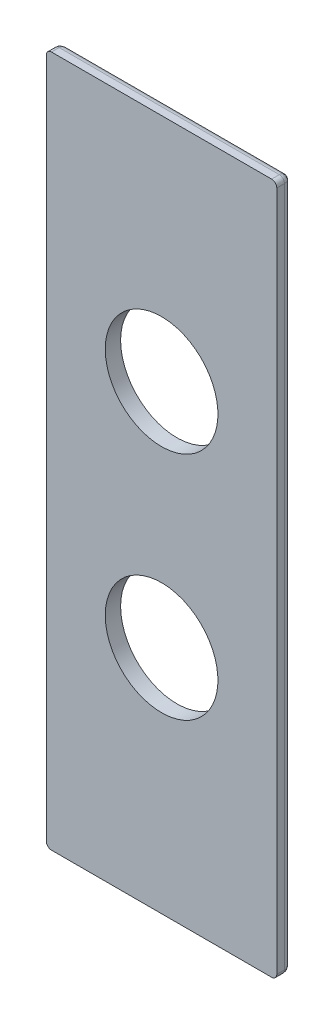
ISO-10303-21;
HEADER;
FILE_DESCRIPTION(('STEP AP214'),'2;1');
FILE_NAME('part.step','',(''),(''),'','','');
FILE_SCHEMA(('AUTOMOTIVE_DESIGN { 1 0 10303 214 1 1 1 1 }'));
ENDSEC;
DATA;
#1=APPLICATION_CONTEXT('core data for automotive mechanical design processes');
#2=APPLICATION_PROTOCOL_DEFINITION('international standard','automotive_design',2000,#1);
#3=PRODUCT_CONTEXT('',#1,'mechanical');
#4=PRODUCT('Part','Part','',(#3));
#5=PRODUCT_RELATED_PRODUCT_CATEGORY('part','',(#4));
#6=PRODUCT_DEFINITION_FORMATION('','',#4);
#7=PRODUCT_DEFINITION_CONTEXT('part definition',#1,'design');
#8=PRODUCT_DEFINITION('design','',#6,#7);
#9=PRODUCT_DEFINITION_SHAPE('','',#8);
#10=(LENGTH_UNIT() NAMED_UNIT(*) SI_UNIT(.MILLI.,.METRE.));
#11=(NAMED_UNIT(*) PLANE_ANGLE_UNIT() SI_UNIT($,.RADIAN.));
#12=(NAMED_UNIT(*) SI_UNIT($,.STERADIAN.) SOLID_ANGLE_UNIT());
#13=UNCERTAINTY_MEASURE_WITH_UNIT(LENGTH_MEASURE(1.E-05),#10,'distance_accuracy_value','');
#14=(GEOMETRIC_REPRESENTATION_CONTEXT(3) GLOBAL_UNCERTAINTY_ASSIGNED_CONTEXT((#13)) GLOBAL_UNIT_ASSIGNED_CONTEXT((#10,
#11,#12)) REPRESENTATION_CONTEXT('',''));
#15=CARTESIAN_POINT('',(0.,0.,0.));
#16=DIRECTION('',(0.,0.,1.));
#17=DIRECTION('',(1.,0.,0.));
#18=AXIS2_PLACEMENT_3D('',#15,#16,#17);
#19=CARTESIAN_POINT('',(21.5,-67.5,1.5));
#20=CARTESIAN_POINT('',(21.6495996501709,-67.5,1.5));
#21=CARTESIAN_POINT('',(21.8738179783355,-67.4486369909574,1.5));
#22=CARTESIAN_POINT('',(22.1286992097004,-67.2883198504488,1.5));
#23=CARTESIAN_POINT('',(22.315061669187,-67.1021470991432,1.5));
#24=CARTESIAN_POINT('',(22.4618744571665,-66.8365612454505,1.5));
#25=CARTESIAN_POINT('',(22.5,-66.6121997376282,1.5));
#26=CARTESIAN_POINT('',(22.5,-66.5,1.5));
#27=CARTESIAN_POINT('',(21.5,-67.5,1.38780026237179));
#28=CARTESIAN_POINT('',(21.6495996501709,-67.5,1.3765841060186));
#29=CARTESIAN_POINT('',(21.8738179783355,-67.4486369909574,1.36367785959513));
#30=CARTESIAN_POINT('',(22.1286992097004,-67.2883198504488,1.35659921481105));
#31=CARTESIAN_POINT('',(22.315061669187,-67.1021470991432,1.3565890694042));
#32=CARTESIAN_POINT('',(22.4618744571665,-66.8365612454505,1.36547389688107));
#33=CARTESIAN_POINT('',(22.5,-66.6121997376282,1.37940644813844));
#34=CARTESIAN_POINT('',(22.5,-66.5,1.38780026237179));
#35=CARTESIAN_POINT('',(21.4936677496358,-67.4810032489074,1.21952596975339));
#36=CARTESIAN_POINT('',(21.6388095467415,-67.4769934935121,1.19181921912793));
#37=CARTESIAN_POINT('',(21.8563501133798,-67.4220055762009,1.15996892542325));
#38=CARTESIAN_POINT('',(22.1051185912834,-67.2621026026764,1.14251249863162));
#39=CARTESIAN_POINT('',(22.2883867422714,-67.0790017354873,1.14248709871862));
#40=CARTESIAN_POINT('',(22.4356025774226,-66.8201958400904,1.16439733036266));
#41=CARTESIAN_POINT('',(22.4779779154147,-66.602519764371,1.19878659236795));
#42=CARTESIAN_POINT('',(22.4810032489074,-66.4936677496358,1.21952596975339));
#43=CARTESIAN_POINT('',(21.462569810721,-67.3877094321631,0.895594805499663));
#44=CARTESIAN_POINT('',(21.5887422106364,-67.3682098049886,0.846186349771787));
#45=CARTESIAN_POINT('',(21.7779308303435,-67.3004944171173,0.789963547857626));
#46=CARTESIAN_POINT('',(21.9999228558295,-67.1445436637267,0.759268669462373));
#47=CARTESIAN_POINT('',(22.1687394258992,-66.9758458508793,0.759230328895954));
#48=CARTESIAN_POINT('',(22.3152388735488,-66.7464583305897,0.797735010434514));
#49=CARTESIAN_POINT('',(22.3731266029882,-66.5572123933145,0.858602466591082));
#50=CARTESIAN_POINT('',(22.3877094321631,-66.462569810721,0.895594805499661));
#51=CARTESIAN_POINT('',(21.3892697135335,-67.1678091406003,0.496992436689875));
#52=CARTESIAN_POINT('',(21.4789201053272,-67.1235219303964,0.445951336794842));
#53=CARTESIAN_POINT('',(21.6134314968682,-67.0389425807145,0.389505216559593));
#54=CARTESIAN_POINT('',(21.7810406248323,-66.8980432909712,0.359033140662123));
#55=CARTESIAN_POINT('',(21.9175825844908,-66.7615406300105,0.359012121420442));
#56=CARTESIAN_POINT('',(22.0546369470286,-66.5910171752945,0.397175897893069));
#57=CARTESIAN_POINT('',(22.1346759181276,-66.4565309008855,0.458744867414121));
#58=CARTESIAN_POINT('',(22.1678091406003,-66.3892697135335,0.496992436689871));
#59=CARTESIAN_POINT('',(21.2243682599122,-66.6731047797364,0.102465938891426));
#60=CARTESIAN_POINT('',(21.2669570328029,-66.6301579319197,0.088465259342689));
#61=CARTESIAN_POINT('',(21.3308775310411,-66.5659359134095,0.073741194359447));
#62=CARTESIAN_POINT('',(21.416229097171,-66.4803146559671,0.065952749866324));
#63=CARTESIAN_POINT('',(21.4910153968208,-66.4055447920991,0.065955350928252));
#64=CARTESIAN_POINT('',(21.5766561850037,-66.3202205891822,0.075680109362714));
#65=CARTESIAN_POINT('',(21.6409626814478,-66.2563274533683,0.091956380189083));
#66=CARTESIAN_POINT('',(21.6731047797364,-66.2243682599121,0.102465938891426));
#67=CARTESIAN_POINT('',(21.0747998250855,-66.2243994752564,0.));
#68=CARTESIAN_POINT('',(21.089047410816,-66.2101518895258,0.));
#69=CARTESIAN_POINT('',(21.1104187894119,-66.18878051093,0.));
#70=CARTESIAN_POINT('',(21.138913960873,-66.1602853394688,0.));
#71=CARTESIAN_POINT('',(21.1638472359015,-66.1353520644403,0.));
#72=CARTESIAN_POINT('',(21.1923424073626,-66.1068568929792,0.));
#73=CARTESIAN_POINT('',(21.2137137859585,-66.0854855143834,0.));
#74=CARTESIAN_POINT('',(21.2243994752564,-66.0747998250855,0.));
#75=CARTESIAN_POINT('',(21.,-66.,0.));
#76=CARTESIAN_POINT('',(21.,-66.,0.));
#77=CARTESIAN_POINT('',(21.,-66.,0.));
#78=CARTESIAN_POINT('',(21.,-66.,0.));
#79=CARTESIAN_POINT('',(21.,-66.,0.));
#80=CARTESIAN_POINT('',(21.,-66.,0.));
#81=CARTESIAN_POINT('',(21.,-66.,0.));
#82=CARTESIAN_POINT('',(21.,-66.,0.));
#83=B_SPLINE_SURFACE_WITH_KNOTS('',3,3,((#19,#20,#21,#22,#23,#24,#25,#26),(#27,#28,#29,#30,#31,
#32,#33,#34),(#35,#36,#37,#38,#39,#40,#41,#42),(#43,#44,#45,#46,#47,#48,#49,#50),(#51,#52,#53,
#54,#55,#56,#57,#58),(#59,#60,#61,#62,#63,#64,#65,#66),(#67,#68,#69,#70,#71,#72,#73,#74),(#75,
#76,#77,#78,#79,#80,#81,#82)),.UNSPECIFIED.,.F.,.F.,.F.,(4,1,1,1,1,4),(4,1,1,1,1,4),(0.,
0.224399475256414,0.336599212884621,0.673198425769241,1.12199737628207,1.5707963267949),(0.,
0.285714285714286,0.428571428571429,0.571428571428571,0.785714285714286,1.),.UNSPECIFIED.);
#84=CARTESIAN_POINT('',(21.,-66.,0.));
#85=CARTESIAN_POINT('',(21.2243994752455,-66.0747998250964,0.));
#86=CARTESIAN_POINT('',(21.6731047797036,-66.2243682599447,0.102465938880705));
#87=CARTESIAN_POINT('',(22.1678091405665,-66.3892697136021,0.496992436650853));
#88=CARTESIAN_POINT('',(22.3877094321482,-66.4625698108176,0.895594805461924));
#89=CARTESIAN_POINT('',(22.4810032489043,-66.4936677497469,1.21952596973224));
#90=CARTESIAN_POINT('',(22.5,-66.5000000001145,1.38780026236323));
#91=CARTESIAN_POINT('',(22.5,-66.5000000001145,1.5));
#92=B_SPLINE_CURVE_WITH_KNOTS('',3,(#84,#85,#86,#87,#88,#89,#90,#91),.UNSPECIFIED.,.F.,.F.,(4,1,
1,1,1,4),(0.,0.448798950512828,0.897597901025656,1.23419711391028,1.34639685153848,
1.5707963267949),.UNSPECIFIED.);
#93=CARTESIAN_POINT('',(22.5,-66.5000000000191,1.5));
#94=VERTEX_POINT('',#93);
#95=CARTESIAN_POINT('',(21.,-66.,0.));
#96=VERTEX_POINT('',#95);
#97=EDGE_CURVE('E113',#94,#96,#92,.F.);
#98=CARTESIAN_POINT('',(22.5,-66.5,1.5));
#99=CARTESIAN_POINT('',(22.5,-66.6121997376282,1.5));
#100=CARTESIAN_POINT('',(22.4618744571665,-66.8365612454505,1.5));
#101=CARTESIAN_POINT('',(22.315061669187,-67.1021470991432,1.5));
#102=CARTESIAN_POINT('',(22.1286992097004,-67.2883198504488,1.5));
#103=CARTESIAN_POINT('',(21.8738179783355,-67.4486369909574,1.5));
#104=CARTESIAN_POINT('',(21.6495996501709,-67.5,1.5));
#105=CARTESIAN_POINT('',(21.5,-67.5,1.5));
#106=B_SPLINE_CURVE_WITH_KNOTS('',3,(#98,#99,#100,#101,#102,#103,#104,#105),.UNSPECIFIED.,.F.,
.F.,(4,1,1,1,1,4),(0.,0.214285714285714,0.428571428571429,0.571428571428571,0.714285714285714,
1.),.UNSPECIFIED.);
#107=CARTESIAN_POINT('',(21.5,-67.5,1.5));
#108=VERTEX_POINT('',#107);
#109=EDGE_CURVE('E96',#94,#108,#106,.T.);
#110=CARTESIAN_POINT('',(21.5,-67.5,1.5));
#111=CARTESIAN_POINT('',(21.5000000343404,-67.5000001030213,1.48036480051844));
#112=CARTESIAN_POINT('',(21.4998707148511,-67.4996121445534,1.46072976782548));
#113=CARTESIAN_POINT('',(21.4993548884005,-67.4980646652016,1.4214906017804));
#114=CARTESIAN_POINT('',(21.498968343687,-67.496905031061,1.40188647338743));
#115=CARTESIAN_POINT('',(21.4979394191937,-67.4938182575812,1.36273904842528));
#116=CARTESIAN_POINT('',(21.497296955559,-67.4918908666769,1.34319577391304));
#117=CARTESIAN_POINT('',(21.4957575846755,-67.4872727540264,1.30419986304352));
#118=CARTESIAN_POINT('',(21.4948605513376,-67.4845816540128,1.28474727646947));
#119=CARTESIAN_POINT('',(21.4928134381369,-67.4784403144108,1.24596255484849));
#120=CARTESIAN_POINT('',(21.4916631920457,-67.474989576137,1.22663050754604));
#121=CARTESIAN_POINT('',(21.4891109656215,-67.4673328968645,1.18811671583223));
#122=CARTESIAN_POINT('',(21.4877087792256,-67.4631263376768,1.16893510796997));
#123=CARTESIAN_POINT('',(21.4846543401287,-67.4539630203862,1.13075190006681));
#124=CARTESIAN_POINT('',(21.4830018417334,-67.4490055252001,1.11175049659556));
#125=CARTESIAN_POINT('',(21.4794494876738,-67.4383484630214,1.07395661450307));
#126=CARTESIAN_POINT('',(21.4775493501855,-67.4326480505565,1.05516440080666));
#127=CARTESIAN_POINT('',(21.4735040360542,-67.4205121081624,1.01781818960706));
#128=CARTESIAN_POINT('',(21.4713585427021,-67.4140756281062,0.999264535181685));
#129=CARTESIAN_POINT('',(21.4668259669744,-67.4004779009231,0.962423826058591));
#130=CARTESIAN_POINT('',(21.4644385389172,-67.3933156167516,0.944137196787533));
#131=CARTESIAN_POINT('',(21.4594269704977,-67.3782809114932,0.907857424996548));
#132=CARTESIAN_POINT('',(21.4568024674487,-67.3704074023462,0.889864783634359));
#133=CARTESIAN_POINT('',(21.4513213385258,-67.3539640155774,0.854200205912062));
#134=CARTESIAN_POINT('',(21.4484643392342,-67.3453930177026,0.836528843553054));
#135=CARTESIAN_POINT('',(21.4425228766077,-67.327568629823,0.801533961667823));
#136=CARTESIAN_POINT('',(21.4394380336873,-67.318314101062,0.784211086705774));
#137=CARTESIAN_POINT('',(21.4330455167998,-67.2991365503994,0.749940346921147));
#138=CARTESIAN_POINT('',(21.4297374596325,-67.2892123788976,0.732993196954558));
#139=CARTESIAN_POINT('',(21.4229031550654,-67.2687094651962,0.699501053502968));
#140=CARTESIAN_POINT('',(21.4193765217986,-67.2581295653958,0.682956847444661));
#141=CARTESIAN_POINT('',(21.4121096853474,-67.2363290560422,0.650297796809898));
#142=CARTESIAN_POINT('',(21.4083690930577,-67.225107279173,0.634183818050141));
#143=CARTESIAN_POINT('',(21.4006790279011,-67.2020370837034,0.602412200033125));
#144=CARTESIAN_POINT('',(21.3967291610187,-67.1901874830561,0.58675551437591));
#145=CARTESIAN_POINT('',(21.388624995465,-67.165874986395,0.555926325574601));
#146=CARTESIAN_POINT('',(21.3844702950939,-67.1534108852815,0.5407548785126));
#147=CARTESIAN_POINT('',(21.3759640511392,-67.1278921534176,0.510916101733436));
#148=CARTESIAN_POINT('',(21.3716121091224,-67.1148363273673,0.496249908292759));
#149=CARTESIAN_POINT('',(21.3627193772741,-67.0881581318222,0.467440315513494));
#150=CARTESIAN_POINT('',(21.358178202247,-67.0745346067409,0.453298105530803));
#151=CARTESIAN_POINT('',(21.3489148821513,-67.0467446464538,0.425555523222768));
#152=CARTESIAN_POINT('',(21.3441923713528,-67.0325771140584,0.411956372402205));
#153=CARTESIAN_POINT('',(21.33457428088,-67.0037228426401,0.385318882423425));
#154=CARTESIAN_POINT('',(21.3296783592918,-66.9890350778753,0.372281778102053));
#155=CARTESIAN_POINT('',(21.3197213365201,-66.9591640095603,0.346787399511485));
#156=CARTESIAN_POINT('',(21.3146599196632,-66.9439797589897,0.334331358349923));
#157=CARTESIAN_POINT('',(21.3043797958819,-66.9131393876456,0.310018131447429));
#158=CARTESIAN_POINT('',(21.2991608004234,-66.8974824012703,0.298162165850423));
#159=CARTESIAN_POINT('',(21.2885734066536,-66.8657202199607,0.275068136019));
#160=CARTESIAN_POINT('',(21.2832047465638,-66.8496142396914,0.263831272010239));
#161=CARTESIAN_POINT('',(21.2723259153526,-66.8169777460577,0.241994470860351));
#162=CARTESIAN_POINT('',(21.2668155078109,-66.8004465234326,0.231395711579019));
#163=CARTESIAN_POINT('',(21.2556610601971,-66.7669831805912,0.210854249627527));
#164=CARTESIAN_POINT('',(21.2500168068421,-66.7500504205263,0.200912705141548));
#165=CARTESIAN_POINT('',(21.2386026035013,-66.7158078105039,0.181704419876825));
#166=CARTESIAN_POINT('',(21.2328324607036,-66.6984973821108,0.172438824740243));
#167=CARTESIAN_POINT('',(21.2211742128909,-66.6635226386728,0.154602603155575));
#168=CARTESIAN_POINT('',(21.2152859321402,-66.6458577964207,0.14603312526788));
#169=CARTESIAN_POINT('',(21.2034002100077,-66.610200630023,0.129603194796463));
#170=CARTESIAN_POINT('',(21.1974026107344,-66.5922078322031,0.12174388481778));
#171=CARTESIAN_POINT('',(21.1853083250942,-66.5559249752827,0.106739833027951));
#172=CARTESIAN_POINT('',(21.17921150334,-66.5376345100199,0.0995961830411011));
#173=CARTESIAN_POINT('',(21.166928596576,-66.5007857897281,0.0860307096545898));
#174=CARTESIAN_POINT('',(21.16074239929,-66.4822271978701,0.0796099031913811));
#175=CARTESIAN_POINT('',(21.148290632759,-66.4448718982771,0.0674969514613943));
#176=CARTESIAN_POINT('',(21.1420249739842,-66.4260749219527,0.0618057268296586));
#177=CARTESIAN_POINT('',(21.1294241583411,-66.3882724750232,0.0511589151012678));
#178=CARTESIAN_POINT('',(21.1230889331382,-66.3692667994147,0.0462041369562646));
#179=CARTESIAN_POINT('',(21.1103588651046,-66.3310765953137,0.0370371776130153));
#180=CARTESIAN_POINT('',(21.1039639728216,-66.3118919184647,0.0328256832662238));
#181=CARTESIAN_POINT('',(21.0911244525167,-66.2733733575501,0.025152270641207));
#182=CARTESIAN_POINT('',(21.0846797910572,-66.2540393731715,0.0216909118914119));
#183=CARTESIAN_POINT('',(21.0717506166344,-66.2152518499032,0.0155247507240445));
#184=CARTESIAN_POINT('',(21.0652660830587,-66.1957982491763,0.0128203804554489));
#185=CARTESIAN_POINT('',(21.0522670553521,-66.1568011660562,0.00817518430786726));
#186=CARTESIAN_POINT('',(21.0457525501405,-66.1372576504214,0.00623466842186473));
#187=CARTESIAN_POINT('',(21.0327034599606,-66.0981103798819,0.0031241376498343));
#188=CARTESIAN_POINT('',(21.026168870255,-66.0785066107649,0.00195432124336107));
#189=CARTESIAN_POINT('',(21.0130895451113,-66.0392686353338,0.000392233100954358));
#190=CARTESIAN_POINT('',(21.0065448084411,-66.0196344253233,6.46496743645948E-08));
#191=CARTESIAN_POINT('',(21.,-66.,0.));
#192=B_SPLINE_CURVE_WITH_KNOTS('',3,(#110,#111,#112,#113,#114,#115,#116,#117,#118,#119,#120,
#121,#122,#123,#124,#125,#126,#127,#128,#129,#130,#131,#132,#133,#134,#135,#136,#137,#138,#139,
#140,#141,#142,#143,#144,#145,#146,#147,#148,#149,#150,#151,#152,#153,#154,#155,#156,#157,#158,
#159,#160,#161,#162,#163,#164,#165,#166,#167,#168,#169,#170,#171,#172,#173,#174,#175,#176,#177,
#178,#179,#180,#181,#182,#183,#184,#185,#186,#187,#188,#189,#190,#191),.UNSPECIFIED.,.F.,.F.,(4,
2,2,2,2,2,2,2,2,2,2,2,2,2,2,2,2,2,2,2,2,2,2,2,2,2,2,2,2,2,2,2,2,2,2,2,2,2,2,2,4),(0.,
0.0589011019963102,0.117810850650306,0.176739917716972,0.235698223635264,0.29469535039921,
0.353740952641,0.412844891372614,0.4720166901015,0.531265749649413,0.590600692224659,
0.650027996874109,0.709552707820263,0.769178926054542,0.828910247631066,0.888750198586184,
0.948702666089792,1.00877232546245,1.06896487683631,1.12928496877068,1.18973449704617,
1.25031310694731,1.31101865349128,1.37184765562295,1.43279574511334,1.49385811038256,
1.55502993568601,1.61630683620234,1.6776852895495,1.73916304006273,1.8007380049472,
1.86240552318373,1.92415874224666,1.98598913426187,2.04788694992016,2.10984166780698,
2.17184244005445,2.23387853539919,2.29593978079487,2.35801700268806,2.42010246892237),.UNSPECIFIED.);
#193=EDGE_CURVE('E117',#96,#108,#192,.F.);
#194=ORIENTED_EDGE('',*,*,#97,.F.);
#195=ORIENTED_EDGE('',*,*,#109,.T.);
#196=ORIENTED_EDGE('',*,*,#193,.F.);
#197=EDGE_LOOP('',(#194,#195,#196));
#198=FACE_BOUND('',#197,.T.);
#199=ADVANCED_FACE('F15',(#198),#83,.T.);
#200=CARTESIAN_POINT('',(22.5,66.5,1.5));
#201=CARTESIAN_POINT('',(22.5,66.649599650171,1.5));
#202=CARTESIAN_POINT('',(22.4486369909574,66.8738179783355,1.5));
#203=CARTESIAN_POINT('',(22.2883198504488,67.1286992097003,1.5));
#204=CARTESIAN_POINT('',(22.1021470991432,67.3150616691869,1.5));
#205=CARTESIAN_POINT('',(21.8365612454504,67.4618744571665,1.5));
#206=CARTESIAN_POINT('',(21.6121997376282,67.5,1.5));
#207=CARTESIAN_POINT('',(21.5,67.5,1.5));
#208=CARTESIAN_POINT('',(22.5,66.5,1.38780026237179));
#209=CARTESIAN_POINT('',(22.5,66.649599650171,1.3765841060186));
#210=CARTESIAN_POINT('',(22.4486369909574,66.8738179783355,1.36367785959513));
#211=CARTESIAN_POINT('',(22.2883198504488,67.1286992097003,1.35659921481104));
#212=CARTESIAN_POINT('',(22.1021470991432,67.3150616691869,1.3565890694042));
#213=CARTESIAN_POINT('',(21.8365612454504,67.4618744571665,1.36547389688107));
#214=CARTESIAN_POINT('',(21.6121997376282,67.5,1.37940644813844));
#215=CARTESIAN_POINT('',(21.5,67.5,1.38780026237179));
#216=CARTESIAN_POINT('',(22.4745870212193,66.4915290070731,1.16354424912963));
#217=CARTESIAN_POINT('',(22.4694358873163,66.6352791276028,1.1300752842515));
#218=CARTESIAN_POINT('',(22.4134457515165,66.8507424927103,1.09154209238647));
#219=CARTESIAN_POINT('',(22.2537321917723,67.0975953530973,1.07040899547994));
#220=CARTESIAN_POINT('',(22.0716177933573,67.2798730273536,1.07037784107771));
#221=CARTESIAN_POINT('',(21.8149302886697,67.4271429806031,1.09690476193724));
#222=CARTESIAN_POINT('',(21.5993392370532,67.4707116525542,1.13849398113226));
#223=CARTESIAN_POINT('',(21.4915290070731,67.4745870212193,1.16354424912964));
#224=CARTESIAN_POINT('',(22.3257585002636,66.4419195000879,0.736975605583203));
#225=CARTESIAN_POINT('',(22.2962162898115,66.5557427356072,0.68063723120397));
#226=CARTESIAN_POINT('',(22.2204085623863,66.7264648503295,0.617015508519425));
#227=CARTESIAN_POINT('',(22.0673073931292,66.9308947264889,0.582383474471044));
#228=CARTESIAN_POINT('',(21.9081734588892,67.0901157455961,0.582345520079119));
#229=CARTESIAN_POINT('',(21.6980442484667,67.2358556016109,0.625770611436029));
#230=CARTESIAN_POINT('',(21.5273088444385,67.3036739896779,0.694786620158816));
#231=CARTESIAN_POINT('',(21.4419195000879,67.3257585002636,0.736975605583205));
#232=CARTESIAN_POINT('',(22.0388385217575,66.3462795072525,0.377495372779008));
#233=CARTESIAN_POINT('',(21.9924880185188,66.4223655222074,0.337547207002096));
#234=CARTESIAN_POINT('',(21.9109760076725,66.536523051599,0.29381832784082));
#235=CARTESIAN_POINT('',(21.7838412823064,66.6810914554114,0.270305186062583));
#236=CARTESIAN_POINT('',(21.663966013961,66.8009930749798,0.270293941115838));
#237=CARTESIAN_POINT('',(21.5174986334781,66.9256165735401,0.299724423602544));
#238=CARTESIAN_POINT('',(21.4033613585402,67.004138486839,0.347551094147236));
#239=CARTESIAN_POINT('',(21.3462795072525,67.0388385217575,0.377495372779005));
#240=CARTESIAN_POINT('',(21.5605778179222,66.1868592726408,0.077186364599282));
#241=CARTESIAN_POINT('',(21.5254468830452,66.2226866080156,0.066456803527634));
#242=CARTESIAN_POINT('',(21.4725851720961,66.2764620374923,0.055005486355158));
#243=CARTESIAN_POINT('',(21.4014686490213,66.3479796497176,0.04891129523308));
#244=CARTESIAN_POINT('',(21.3390620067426,66.4104029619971,0.048911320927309));
#245=CARTESIAN_POINT('',(21.2674966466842,66.4814436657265,0.056527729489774));
#246=CARTESIAN_POINT('',(21.2137463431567,66.534292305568,0.069135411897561));
#247=CARTESIAN_POINT('',(21.1868592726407,66.5605778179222,0.077186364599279));
#248=CARTESIAN_POINT('',(21.2243994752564,66.0747998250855,0.));
#249=CARTESIAN_POINT('',(21.2101518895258,66.089047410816,0.));
#250=CARTESIAN_POINT('',(21.18878051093,66.1104187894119,0.));
#251=CARTESIAN_POINT('',(21.1602853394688,66.138913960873,0.));
#252=CARTESIAN_POINT('',(21.1353520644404,66.1638472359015,0.));
#253=CARTESIAN_POINT('',(21.1068568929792,66.1923424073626,0.));
#254=CARTESIAN_POINT('',(21.0854855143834,66.2137137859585,0.));
#255=CARTESIAN_POINT('',(21.0747998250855,66.2243994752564,0.));
#256=CARTESIAN_POINT('',(21.,66.,0.));
#257=CARTESIAN_POINT('',(21.,66.,0.));
#258=CARTESIAN_POINT('',(21.,66.,0.));
#259=CARTESIAN_POINT('',(21.,66.,0.));
#260=CARTESIAN_POINT('',(21.,66.,0.));
#261=CARTESIAN_POINT('',(21.,66.,0.));
#262=CARTESIAN_POINT('',(21.,66.,0.));
#263=CARTESIAN_POINT('',(21.,66.,0.));
#264=B_SPLINE_SURFACE_WITH_KNOTS('',3,3,((#200,#201,#202,#203,#204,#205,#206,#207),(#208,#209,
#210,#211,#212,#213,#214,#215),(#216,#217,#218,#219,#220,#221,#222,#223),(#224,#225,#226,#227,
#228,#229,#230,#231),(#232,#233,#234,#235,#236,#237,#238,#239),(#240,#241,#242,#243,#244,#245,
#246,#247),(#248,#249,#250,#251,#252,#253,#254,#255),(#256,#257,#258,#259,#260,#261,#262,#263)),
.UNSPECIFIED.,.F.,.F.,.F.,(4,1,1,1,1,4),(4,1,1,1,1,4),(0.,0.224399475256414,0.448798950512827,
0.897597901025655,1.12199737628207,1.5707963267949),(0.,0.285714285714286,0.428571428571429,
0.571428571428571,0.785714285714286,1.),.UNSPECIFIED.);
#265=CARTESIAN_POINT('',(21.,66.,0.));
#266=CARTESIAN_POINT('',(21.0747998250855,66.2243994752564,0.));
#267=CARTESIAN_POINT('',(21.1868592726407,66.5605778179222,0.0771863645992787));
#268=CARTESIAN_POINT('',(21.3462795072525,67.0388385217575,0.377495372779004));
#269=CARTESIAN_POINT('',(21.4419195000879,67.3257585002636,0.736975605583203));
#270=CARTESIAN_POINT('',(21.4915290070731,67.4745870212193,1.16354424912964));
#271=CARTESIAN_POINT('',(21.5,67.5,1.38780026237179));
#272=CARTESIAN_POINT('',(21.5,67.5,1.5));
#273=B_SPLINE_CURVE_WITH_KNOTS('',3,(#265,#266,#267,#268,#269,#270,#271,#272),.UNSPECIFIED.,.F.,
.F.,(4,1,1,1,1,4),(0.,0.448798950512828,0.673198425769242,1.12199737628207,1.34639685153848,
1.5707963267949),.UNSPECIFIED.);
#274=CARTESIAN_POINT('',(21.5,67.5,1.5));
#275=VERTEX_POINT('',#274);
#276=CARTESIAN_POINT('',(21.,66.,0.));
#277=VERTEX_POINT('',#276);
#278=EDGE_CURVE('E225',#275,#277,#273,.F.);
#279=CARTESIAN_POINT('',(21.5,67.5,1.5));
#280=CARTESIAN_POINT('',(21.6121997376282,67.5,1.5));
#281=CARTESIAN_POINT('',(21.8365612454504,67.4618744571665,1.5));
#282=CARTESIAN_POINT('',(22.1021470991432,67.3150616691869,1.5));
#283=CARTESIAN_POINT('',(22.2883198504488,67.1286992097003,1.5));
#284=CARTESIAN_POINT('',(22.4486369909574,66.8738179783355,1.5));
#285=CARTESIAN_POINT('',(22.5,66.649599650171,1.5));
#286=CARTESIAN_POINT('',(22.5,66.5,1.5));
#287=B_SPLINE_CURVE_WITH_KNOTS('',3,(#279,#280,#281,#282,#283,#284,#285,#286),.UNSPECIFIED.,.F.,
.F.,(4,1,1,1,1,4),(0.,0.214285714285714,0.428571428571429,0.571428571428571,0.714285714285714,
1.),.UNSPECIFIED.);
#288=CARTESIAN_POINT('',(22.5,66.5,1.5));
#289=VERTEX_POINT('',#288);
#290=EDGE_CURVE('E109',#275,#289,#287,.T.);
#291=CARTESIAN_POINT('',(22.5,66.5,1.5));
#292=CARTESIAN_POINT('',(22.5,66.5,1.38780026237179));
#293=CARTESIAN_POINT('',(22.4745870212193,66.4915290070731,1.16354424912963));
#294=CARTESIAN_POINT('',(22.3257585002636,66.4419195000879,0.7369756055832));
#295=CARTESIAN_POINT('',(22.0388385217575,66.3462795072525,0.377495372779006));
#296=CARTESIAN_POINT('',(21.5605778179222,66.1868592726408,0.0771863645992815));
#297=CARTESIAN_POINT('',(21.2243994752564,66.0747998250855,0.));
#298=CARTESIAN_POINT('',(21.,66.,0.));
#299=B_SPLINE_CURVE_WITH_KNOTS('',3,(#291,#292,#293,#294,#295,#296,#297,#298),.UNSPECIFIED.,.F.,
.F.,(4,1,1,1,1,4),(0.,0.224399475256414,0.448798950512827,0.897597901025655,1.12199737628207,
1.5707963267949),.UNSPECIFIED.);
#300=EDGE_CURVE('E125',#277,#289,#299,.F.);
#301=ORIENTED_EDGE('',*,*,#278,.F.);
#302=ORIENTED_EDGE('',*,*,#290,.T.);
#303=ORIENTED_EDGE('',*,*,#300,.F.);
#304=EDGE_LOOP('',(#301,#302,#303));
#305=FACE_BOUND('',#304,.T.);
#306=ADVANCED_FACE('F330',(#305),#264,.T.);
#307=CARTESIAN_POINT('',(-21.5,67.5,1.5));
#308=CARTESIAN_POINT('',(-21.649599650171,67.5,1.5));
#309=CARTESIAN_POINT('',(-21.8738179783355,67.4486369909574,1.5));
#310=CARTESIAN_POINT('',(-22.1286992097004,67.2883198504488,1.5));
#311=CARTESIAN_POINT('',(-22.315061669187,67.1021470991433,1.5));
#312=CARTESIAN_POINT('',(-22.4618744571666,66.8365612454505,1.5));
#313=CARTESIAN_POINT('',(-22.5,66.6121997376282,1.5));
#314=CARTESIAN_POINT('',(-22.5,66.5,1.5));
#315=CARTESIAN_POINT('',(-21.5,67.5,1.38780026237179));
#316=CARTESIAN_POINT('',(-21.649599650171,67.5,1.3765841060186));
#317=CARTESIAN_POINT('',(-21.8738179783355,67.4486369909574,1.36367785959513));
#318=CARTESIAN_POINT('',(-22.1286992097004,67.2883198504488,1.35659921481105));
#319=CARTESIAN_POINT('',(-22.315061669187,67.1021470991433,1.3565890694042));
#320=CARTESIAN_POINT('',(-22.4618744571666,66.8365612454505,1.36547389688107));
#321=CARTESIAN_POINT('',(-22.5,66.6121997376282,1.37940644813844));
#322=CARTESIAN_POINT('',(-22.5,66.5,1.3878002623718));
#323=CARTESIAN_POINT('',(-21.4936677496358,67.4810032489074,1.2195259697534));
#324=CARTESIAN_POINT('',(-21.6388095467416,67.4769934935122,1.19181921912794));
#325=CARTESIAN_POINT('',(-21.8563501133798,67.4220055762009,1.15996892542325));
#326=CARTESIAN_POINT('',(-22.1051185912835,67.2621026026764,1.14251249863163));
#327=CARTESIAN_POINT('',(-22.2883867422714,67.0790017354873,1.14248709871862));
#328=CARTESIAN_POINT('',(-22.4356025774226,66.8201958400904,1.16439733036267));
#329=CARTESIAN_POINT('',(-22.4779779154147,66.602519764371,1.19878659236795));
#330=CARTESIAN_POINT('',(-22.4810032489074,66.4936677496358,1.21952596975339));
#331=CARTESIAN_POINT('',(-21.462569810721,67.3877094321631,0.895594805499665));
#332=CARTESIAN_POINT('',(-21.5887422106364,67.3682098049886,0.846186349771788));
#333=CARTESIAN_POINT('',(-21.7779308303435,67.3004944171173,0.78996354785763));
#334=CARTESIAN_POINT('',(-21.9999228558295,67.1445436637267,0.759268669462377));
#335=CARTESIAN_POINT('',(-22.1687394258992,66.9758458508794,0.759230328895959));
#336=CARTESIAN_POINT('',(-22.3152388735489,66.7464583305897,0.797735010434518));
#337=CARTESIAN_POINT('',(-22.3731266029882,66.5572123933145,0.858602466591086));
#338=CARTESIAN_POINT('',(-22.3877094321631,66.462569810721,0.895594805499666));
#339=CARTESIAN_POINT('',(-21.3892697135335,67.1678091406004,0.496992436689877));
#340=CARTESIAN_POINT('',(-21.4789201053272,67.1235219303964,0.445951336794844));
#341=CARTESIAN_POINT('',(-21.6134314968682,67.0389425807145,0.389505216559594));
#342=CARTESIAN_POINT('',(-21.7810406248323,66.8980432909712,0.359033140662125));
#343=CARTESIAN_POINT('',(-21.9175825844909,66.7615406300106,0.359012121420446));
#344=CARTESIAN_POINT('',(-22.0546369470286,66.5910171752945,0.397175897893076));
#345=CARTESIAN_POINT('',(-22.1346759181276,66.4565309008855,0.458744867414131));
#346=CARTESIAN_POINT('',(-22.1678091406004,66.3892697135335,0.496992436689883));
#347=CARTESIAN_POINT('',(-21.2243682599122,66.6731047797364,0.102465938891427));
#348=CARTESIAN_POINT('',(-21.2669570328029,66.6301579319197,0.088465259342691));
#349=CARTESIAN_POINT('',(-21.3308775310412,66.5659359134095,0.073741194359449));
#350=CARTESIAN_POINT('',(-21.416229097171,66.4803146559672,0.065952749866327));
#351=CARTESIAN_POINT('',(-21.4910153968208,66.4055447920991,0.065955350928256));
#352=CARTESIAN_POINT('',(-21.5766561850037,66.3202205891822,0.075680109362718));
#353=CARTESIAN_POINT('',(-21.6409626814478,66.2563274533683,0.091956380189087));
#354=CARTESIAN_POINT('',(-21.6731047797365,66.2243682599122,0.102465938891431));
#355=CARTESIAN_POINT('',(-21.0747998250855,66.2243994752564,0.));
#356=CARTESIAN_POINT('',(-21.0890474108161,66.2101518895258,0.));
#357=CARTESIAN_POINT('',(-21.1104187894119,66.18878051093,0.));
#358=CARTESIAN_POINT('',(-21.138913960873,66.1602853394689,0.));
#359=CARTESIAN_POINT('',(-21.1638472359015,66.1353520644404,0.));
#360=CARTESIAN_POINT('',(-21.1923424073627,66.1068568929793,0.));
#361=CARTESIAN_POINT('',(-21.2137137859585,66.0854855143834,0.));
#362=CARTESIAN_POINT('',(-21.2243994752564,66.0747998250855,0.));
#363=CARTESIAN_POINT('',(-21.,66.,0.));
#364=CARTESIAN_POINT('',(-21.,66.,0.));
#365=CARTESIAN_POINT('',(-21.,66.,0.));
#366=CARTESIAN_POINT('',(-21.,66.,0.));
#367=CARTESIAN_POINT('',(-21.,66.,0.));
#368=CARTESIAN_POINT('',(-21.,66.,0.));
#369=CARTESIAN_POINT('',(-21.,66.,0.));
#370=CARTESIAN_POINT('',(-21.,66.,0.));
#371=B_SPLINE_SURFACE_WITH_KNOTS('',3,3,((#307,#308,#309,#310,#311,#312,#313,#314),(#315,#316,
#317,#318,#319,#320,#321,#322),(#323,#324,#325,#326,#327,#328,#329,#330),(#331,#332,#333,#334,
#335,#336,#337,#338),(#339,#340,#341,#342,#343,#344,#345,#346),(#347,#348,#349,#350,#351,#352,
#353,#354),(#355,#356,#357,#358,#359,#360,#361,#362),(#363,#364,#365,#366,#367,#368,#369,#370)),
.UNSPECIFIED.,.F.,.F.,.F.,(4,1,1,1,1,4),(4,1,1,1,1,4),(0.,0.224399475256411,0.336599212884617,
0.673198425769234,1.12199737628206,1.57079632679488),(0.,0.285714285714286,0.428571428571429,
0.571428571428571,0.785714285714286,1.),.UNSPECIFIED.);
#372=CARTESIAN_POINT('',(-21.,66.,0.));
#373=CARTESIAN_POINT('',(-21.2243994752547,66.0747998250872,0.));
#374=CARTESIAN_POINT('',(-21.6731047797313,66.2243682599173,0.102465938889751));
#375=CARTESIAN_POINT('',(-22.1678091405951,66.3892697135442,0.496992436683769));
#376=CARTESIAN_POINT('',(-22.3877094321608,66.4625698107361,0.895594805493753));
#377=CARTESIAN_POINT('',(-22.4810032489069,66.4936677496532,1.21952596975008));
#378=CARTESIAN_POINT('',(-22.5,66.5000000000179,1.38780026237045));
#379=CARTESIAN_POINT('',(-22.5,66.5000000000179,1.5));
#380=B_SPLINE_CURVE_WITH_KNOTS('',3,(#372,#373,#374,#375,#376,#377,#378,#379),.UNSPECIFIED.,.F.,
.F.,(4,1,1,1,1,4),(0.,0.448798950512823,0.897597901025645,1.23419711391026,1.34639685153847,
1.57079632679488),.UNSPECIFIED.);
#381=CARTESIAN_POINT('',(-22.5,66.500000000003,1.5));
#382=VERTEX_POINT('',#381);
#383=CARTESIAN_POINT('',(-21.,66.,0.));
#384=VERTEX_POINT('',#383);
#385=EDGE_CURVE('E173',#382,#384,#380,.F.);
#386=CARTESIAN_POINT('',(-22.5,66.5,1.5));
#387=CARTESIAN_POINT('',(-22.5000000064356,66.5130898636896,1.5));
#388=CARTESIAN_POINT('',(-22.49974053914,66.5261796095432,1.5));
#389=CARTESIAN_POINT('',(-22.4987060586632,66.5523386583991,1.5));
#390=CARTESIAN_POINT('',(-22.4979310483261,66.5654079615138,1.5));
#391=CARTESIAN_POINT('',(-22.49586887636,66.5915061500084,1.5));
#392=CARTESIAN_POINT('',(-22.4945817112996,66.6045350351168,1.5));
#393=CARTESIAN_POINT('',(-22.4914986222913,66.6305324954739,1.5));
#394=CARTESIAN_POINT('',(-22.4897026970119,66.6435010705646,1.5));
#395=CARTESIAN_POINT('',(-22.4856054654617,66.6693579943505,1.5));
#396=CARTESIAN_POINT('',(-22.4833041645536,66.6822463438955,1.5));
#397=CARTESIAN_POINT('',(-22.4781995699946,66.7079229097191,1.5));
#398=CARTESIAN_POINT('',(-22.4753962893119,66.7207111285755,1.5));
#399=CARTESIAN_POINT('',(-22.4692910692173,66.7461675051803,1.5));
#400=CARTESIAN_POINT('',(-22.4659891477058,66.7588356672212,1.5));
#401=CARTESIAN_POINT('',(-22.4588901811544,66.7840320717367,1.5));
#402=CARTESIAN_POINT('',(-22.4550931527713,66.7965603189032,1.5));
#403=CARTESIAN_POINT('',(-22.4470067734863,66.8214567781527,1.5));
#404=CARTESIAN_POINT('',(-22.4427174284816,66.8338249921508,1.5));
#405=CARTESIAN_POINT('',(-22.433652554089,66.8583822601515,1.5));
#406=CARTESIAN_POINT('',(-22.4288770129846,66.8705713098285,1.5));
#407=CARTESIAN_POINT('',(-22.4188503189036,66.894752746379,1.5));
#408=CARTESIAN_POINT('',(-22.413599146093,66.9067451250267,1.5));
#409=CARTESIAN_POINT('',(-22.4026308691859,66.9305154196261,1.5));
#410=CARTESIAN_POINT('',(-22.3969137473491,66.9422933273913,1.5));
#411=CARTESIAN_POINT('',(-22.3850234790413,66.9656169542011,1.5));
#412=CARTESIAN_POINT('',(-22.3788503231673,66.9771626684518,1.5));
#413=CARTESIAN_POINT('',(-22.3660578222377,67.000004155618,1.5));
#414=CARTESIAN_POINT('',(-22.3594384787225,67.0112999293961,1.5));
#415=CARTESIAN_POINT('',(-22.3457634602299,67.0336237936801,1.5));
#416=CARTESIAN_POINT('',(-22.3387077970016,67.0446518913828,1.5));
#417=CARTESIAN_POINT('',(-22.3241699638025,67.06642263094,1.5));
#418=CARTESIAN_POINT('',(-22.3166878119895,67.077165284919,1.5));
#419=CARTESIAN_POINT('',(-22.3013069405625,67.0983474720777,1.5));
#420=CARTESIAN_POINT('',(-22.2934082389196,67.1087870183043,1.5));
#421=CARTESIAN_POINT('',(-22.277203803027,67.1293449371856,1.5));
#422=CARTESIAN_POINT('',(-22.2688980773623,67.139463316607,1.5));
#423=CARTESIAN_POINT('',(-22.2518939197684,67.1593647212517,1.5));
#424=CARTESIAN_POINT('',(-22.2431954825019,67.169147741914,1.5));
#425=CARTESIAN_POINT('',(-22.2254208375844,67.1883649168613,1.5));
#426=CARTESIAN_POINT('',(-22.2163446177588,67.1977990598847,1.5));
#427=CARTESIAN_POINT('',(-22.1978291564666,67.2163047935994,1.5));
#428=CARTESIAN_POINT('',(-22.1883899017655,67.2253763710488,1.5));
#429=CARTESIAN_POINT('',(-22.1691631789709,67.2431433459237,1.5));
#430=CARTESIAN_POINT('',(-22.1593756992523,67.2518387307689,1.5));
#431=CARTESIAN_POINT('',(-22.13946725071,67.2688396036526,1.5));
#432=CARTESIAN_POINT('',(-22.1293462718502,67.2771450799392,1.5));
#433=CARTESIAN_POINT('',(-22.1087858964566,67.2933526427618,1.5));
#434=CARTESIAN_POINT('',(-22.0983464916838,67.3012547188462,1.5));
#435=CARTESIAN_POINT('',(-22.0771661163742,67.3166438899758,1.5));
#436=CARTESIAN_POINT('',(-22.0664251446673,67.3241309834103,1.5));
#437=CARTESIAN_POINT('',(-22.0446583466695,67.3386784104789,1.5));
#438=CARTESIAN_POINT('',(-22.0336325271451,67.3457387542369,1.5));
#439=CARTESIAN_POINT('',(-22.0113127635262,67.3594208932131,1.5));
#440=CARTESIAN_POINT('',(-22.0000188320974,67.3660427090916,1.5));
#441=CARTESIAN_POINT('',(-21.9771796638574,67.3788361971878,1.5));
#442=CARTESIAN_POINT('',(-21.9656344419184,67.3850078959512,1.5));
#443=CARTESIAN_POINT('',(-21.9423091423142,67.3968888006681,1.5));
#444=CARTESIAN_POINT('',(-21.9305290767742,67.4025980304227,1.5));
#445=CARTESIAN_POINT('',(-21.9067521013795,67.4135450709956,1.5));
#446=CARTESIAN_POINT('',(-21.8947551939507,67.4187828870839,1.5));
#447=CARTESIAN_POINT('',(-21.8705644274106,67.4287829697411,1.5));
#448=CARTESIAN_POINT('',(-21.8583705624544,67.433545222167,1.5));
#449=CARTESIAN_POINT('',(-21.8338053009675,67.4425891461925,1.5));
#450=CARTESIAN_POINT('',(-21.8214338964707,67.4468707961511,1.5));
#451=CARTESIAN_POINT('',(-21.7965330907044,67.454948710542,1.5));
#452=CARTESIAN_POINT('',(-21.7840036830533,67.4587449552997,1.5));
#453=CARTESIAN_POINT('',(-21.7588063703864,67.4658471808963,1.5));
#454=CARTESIAN_POINT('',(-21.7461384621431,67.4691531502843,1.5));
#455=CARTESIAN_POINT('',(-21.7206836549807,67.4752699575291,1.5));
#456=CARTESIAN_POINT('',(-21.7078967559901,67.4780807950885,1.5));
#457=CARTESIAN_POINT('',(-21.6822234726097,67.4832024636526,1.5));
#458=CARTESIAN_POINT('',(-21.6693370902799,67.485513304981,1.5));
#459=CARTESIAN_POINT('',(-21.6434843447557,67.4896301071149,1.5));
#460=CARTESIAN_POINT('',(-21.63051798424,67.4914360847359,1.5));
#461=CARTESIAN_POINT('',(-21.6045247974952,67.4945382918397,1.5));
#462=CARTESIAN_POINT('',(-21.5914979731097,67.4958345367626,1.5));
#463=CARTESIAN_POINT('',(-21.5654033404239,67.4979124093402,1.5));
#464=CARTESIAN_POINT('',(-21.5523355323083,67.4986940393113,1.5));
#465=CARTESIAN_POINT('',(-21.5261785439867,67.4997378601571,1.5));
#466=CARTESIAN_POINT('',(-21.5130893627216,67.5000000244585,1.5));
#467=CARTESIAN_POINT('',(-21.5,67.5,1.5));
#468=B_SPLINE_CURVE_WITH_KNOTS('',3,(#386,#387,#388,#389,#390,#391,#392,#393,#394,#395,#396,
#397,#398,#399,#400,#401,#402,#403,#404,#405,#406,#407,#408,#409,#410,#411,#412,#413,#414,#415,
#416,#417,#418,#419,#420,#421,#422,#423,#424,#425,#426,#427,#428,#429,#430,#431,#432,#433,#434,
#435,#436,#437,#438,#439,#440,#441,#442,#443,#444,#445,#446,#447,#448,#449,#450,#451,#452,#453,
#454,#455,#456,#457,#458,#459,#460,#461,#462,#463,#464,#465,#466,#467),.UNSPECIFIED.,.F.,.F.,(4,
2,2,2,2,2,2,2,2,2,2,2,2,2,2,2,2,2,2,2,2,2,2,2,2,2,2,2,2,2,2,2,2,2,2,2,2,2,2,2,4),(0.,
0.0392668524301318,0.0785334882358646,0.117800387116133,0.157067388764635,0.196333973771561,
0.235599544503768,0.274863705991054,0.314126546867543,0.353388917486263,0.392652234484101,
0.431917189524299,0.471183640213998,0.510450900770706,0.549718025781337,0.58898409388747,
0.628248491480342,0.667511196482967,0.706773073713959,0.746035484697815,0.785299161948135,
0.824564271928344,0.863830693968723,0.903098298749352,0.942366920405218,0.981635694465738,
1.02090353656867,1.06016952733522,1.09943320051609,1.13869485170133,1.1779560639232,
1.21721844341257,1.25648259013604,1.29574832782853,1.33501498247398,1.37428166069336,
1.4135475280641,1.45281208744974,1.49207545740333,1.53133865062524,1.57060385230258),.UNSPECIFIED.);
#469=CARTESIAN_POINT('',(-21.5,67.5,1.5));
#470=VERTEX_POINT('',#469);
#471=EDGE_CURVE('E357',#382,#470,#468,.T.);
#472=CARTESIAN_POINT('',(-21.5,67.5,1.5));
#473=CARTESIAN_POINT('',(-21.5000000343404,67.5000001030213,1.48036480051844));
#474=CARTESIAN_POINT('',(-21.4998707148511,67.4996121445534,1.46072976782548));
#475=CARTESIAN_POINT('',(-21.4993548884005,67.4980646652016,1.4214906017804));
#476=CARTESIAN_POINT('',(-21.498968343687,67.496905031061,1.40188647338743));
#477=CARTESIAN_POINT('',(-21.4979394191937,67.4938182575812,1.36273904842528));
#478=CARTESIAN_POINT('',(-21.497296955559,67.4918908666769,1.34319577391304));
#479=CARTESIAN_POINT('',(-21.4957575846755,67.4872727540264,1.30419986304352));
#480=CARTESIAN_POINT('',(-21.4948605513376,67.4845816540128,1.28474727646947));
#481=CARTESIAN_POINT('',(-21.4928134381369,67.4784403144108,1.24596255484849));
#482=CARTESIAN_POINT('',(-21.4916631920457,67.474989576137,1.22663050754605));
#483=CARTESIAN_POINT('',(-21.4891109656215,67.4673328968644,1.18811671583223));
#484=CARTESIAN_POINT('',(-21.4877087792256,67.4631263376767,1.16893510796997));
#485=CARTESIAN_POINT('',(-21.4846543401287,67.4539630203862,1.13075190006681));
#486=CARTESIAN_POINT('',(-21.4830018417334,67.4490055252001,1.11175049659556));
#487=CARTESIAN_POINT('',(-21.4794494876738,67.4383484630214,1.07395661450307));
#488=CARTESIAN_POINT('',(-21.4775493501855,67.4326480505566,1.05516440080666));
#489=CARTESIAN_POINT('',(-21.4735040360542,67.4205121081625,1.01781818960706));
#490=CARTESIAN_POINT('',(-21.4713585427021,67.4140756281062,0.999264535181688));
#491=CARTESIAN_POINT('',(-21.4668259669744,67.4004779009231,0.962423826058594));
#492=CARTESIAN_POINT('',(-21.4644385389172,67.3933156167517,0.944137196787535));
#493=CARTESIAN_POINT('',(-21.4594269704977,67.3782809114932,0.907857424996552));
#494=CARTESIAN_POINT('',(-21.4568024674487,67.3704074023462,0.889864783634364));
#495=CARTESIAN_POINT('',(-21.4513213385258,67.3539640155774,0.854200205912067));
#496=CARTESIAN_POINT('',(-21.4484643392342,67.3453930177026,0.836528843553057));
#497=CARTESIAN_POINT('',(-21.4425228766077,67.3275686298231,0.801533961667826));
#498=CARTESIAN_POINT('',(-21.4394380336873,67.318314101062,0.784211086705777));
#499=CARTESIAN_POINT('',(-21.4330455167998,67.2991365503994,0.74994034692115));
#500=CARTESIAN_POINT('',(-21.4297374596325,67.2892123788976,0.732993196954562));
#501=CARTESIAN_POINT('',(-21.4229031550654,67.2687094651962,0.699501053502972));
#502=CARTESIAN_POINT('',(-21.4193765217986,67.2581295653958,0.682956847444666));
#503=CARTESIAN_POINT('',(-21.4121096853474,67.2363290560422,0.650297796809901));
#504=CARTESIAN_POINT('',(-21.4083690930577,67.225107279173,0.634183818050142));
#505=CARTESIAN_POINT('',(-21.4006790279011,67.2020370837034,0.602412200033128));
#506=CARTESIAN_POINT('',(-21.3967291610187,67.1901874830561,0.586755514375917));
#507=CARTESIAN_POINT('',(-21.388624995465,67.165874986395,0.555926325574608));
#508=CARTESIAN_POINT('',(-21.3844702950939,67.1534108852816,0.540754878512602));
#509=CARTESIAN_POINT('',(-21.3759640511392,67.1278921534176,0.510916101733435));
#510=CARTESIAN_POINT('',(-21.3716121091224,67.1148363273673,0.496249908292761));
#511=CARTESIAN_POINT('',(-21.3627193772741,67.0881581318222,0.467440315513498));
#512=CARTESIAN_POINT('',(-21.358178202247,67.074534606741,0.453298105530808));
#513=CARTESIAN_POINT('',(-21.3489148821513,67.0467446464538,0.425555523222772));
#514=CARTESIAN_POINT('',(-21.3441923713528,67.0325771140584,0.411956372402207));
#515=CARTESIAN_POINT('',(-21.3345742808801,67.0037228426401,0.385318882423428));
#516=CARTESIAN_POINT('',(-21.3296783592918,66.9890350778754,0.37228177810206));
#517=CARTESIAN_POINT('',(-21.3197213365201,66.9591640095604,0.346787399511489));
#518=CARTESIAN_POINT('',(-21.3146599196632,66.9439797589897,0.33433135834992));
#519=CARTESIAN_POINT('',(-21.3043797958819,66.9131393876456,0.310018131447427));
#520=CARTESIAN_POINT('',(-21.2991608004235,66.8974824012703,0.298162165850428));
#521=CARTESIAN_POINT('',(-21.2885734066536,66.8657202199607,0.275068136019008));
#522=CARTESIAN_POINT('',(-21.2832047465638,66.8496142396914,0.263831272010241));
#523=CARTESIAN_POINT('',(-21.2723259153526,66.8169777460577,0.241994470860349));
#524=CARTESIAN_POINT('',(-21.2668155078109,66.8004465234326,0.231395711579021));
#525=CARTESIAN_POINT('',(-21.2556610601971,66.7669831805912,0.210854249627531));
#526=CARTESIAN_POINT('',(-21.2500168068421,66.7500504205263,0.200912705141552));
#527=CARTESIAN_POINT('',(-21.2386026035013,66.7158078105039,0.181704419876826));
#528=CARTESIAN_POINT('',(-21.2328324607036,66.6984973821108,0.172438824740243));
#529=CARTESIAN_POINT('',(-21.2211742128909,66.6635226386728,0.154602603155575));
#530=CARTESIAN_POINT('',(-21.2152859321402,66.6458577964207,0.146033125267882));
#531=CARTESIAN_POINT('',(-21.2034002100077,66.610200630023,0.129603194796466));
#532=CARTESIAN_POINT('',(-21.1974026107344,66.5922078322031,0.121743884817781));
#533=CARTESIAN_POINT('',(-21.1853083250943,66.5559249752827,0.106739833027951));
#534=CARTESIAN_POINT('',(-21.17921150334,66.5376345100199,0.0995961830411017));
#535=CARTESIAN_POINT('',(-21.166928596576,66.5007857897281,0.0860307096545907));
#536=CARTESIAN_POINT('',(-21.16074239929,66.4822271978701,0.0796099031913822));
#537=CARTESIAN_POINT('',(-21.148290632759,66.4448718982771,0.067496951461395));
#538=CARTESIAN_POINT('',(-21.1420249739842,66.4260749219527,0.0618057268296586));
#539=CARTESIAN_POINT('',(-21.1294241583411,66.3882724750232,0.051158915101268));
#540=CARTESIAN_POINT('',(-21.1230889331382,66.3692667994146,0.0462041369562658));
#541=CARTESIAN_POINT('',(-21.1103588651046,66.3310765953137,0.0370371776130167));
#542=CARTESIAN_POINT('',(-21.1039639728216,66.3118919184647,0.0328256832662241));
#543=CARTESIAN_POINT('',(-21.0911244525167,66.2733733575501,0.0251522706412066));
#544=CARTESIAN_POINT('',(-21.0846797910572,66.2540393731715,0.0216909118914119));
#545=CARTESIAN_POINT('',(-21.0717506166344,66.2152518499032,0.0155247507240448));
#546=CARTESIAN_POINT('',(-21.0652660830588,66.1957982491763,0.012820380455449));
#547=CARTESIAN_POINT('',(-21.0522670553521,66.1568011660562,0.00817518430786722));
#548=CARTESIAN_POINT('',(-21.0457525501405,66.1372576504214,0.0062346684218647));
#549=CARTESIAN_POINT('',(-21.0327034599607,66.0981103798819,0.00312413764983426));
#550=CARTESIAN_POINT('',(-21.026168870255,66.0785066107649,0.00195432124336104));
#551=CARTESIAN_POINT('',(-21.0130895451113,66.0392686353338,0.000392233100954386));
#552=CARTESIAN_POINT('',(-21.0065448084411,66.0196344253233,6.46496744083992E-08));
#553=CARTESIAN_POINT('',(-21.,66.,0.));
#554=B_SPLINE_CURVE_WITH_KNOTS('',3,(#472,#473,#474,#475,#476,#477,#478,#479,#480,#481,#482,
#483,#484,#485,#486,#487,#488,#489,#490,#491,#492,#493,#494,#495,#496,#497,#498,#499,#500,#501,
#502,#503,#504,#505,#506,#507,#508,#509,#510,#511,#512,#513,#514,#515,#516,#517,#518,#519,#520,
#521,#522,#523,#524,#525,#526,#527,#528,#529,#530,#531,#532,#533,#534,#535,#536,#537,#538,#539,
#540,#541,#542,#543,#544,#545,#546,#547,#548,#549,#550,#551,#552,#553),.UNSPECIFIED.,.F.,.F.,(4,
2,2,2,2,2,2,2,2,2,2,2,2,2,2,2,2,2,2,2,2,2,2,2,2,2,2,2,2,2,2,2,2,2,2,2,2,2,2,2,4),(0.,
0.0589011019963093,0.117810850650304,0.176739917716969,0.23569822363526,0.294695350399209,
0.353740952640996,0.412844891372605,0.472016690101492,0.531265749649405,0.590600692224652,
0.650027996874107,0.709552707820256,0.769178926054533,0.828910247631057,0.888750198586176,
0.948702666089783,1.00877232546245,1.06896487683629,1.12928496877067,1.18973449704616,
1.2503131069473,1.31101865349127,1.37184765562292,1.43279574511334,1.49385811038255,
1.55502993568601,1.61630683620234,1.67768528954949,1.73916304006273,1.8007380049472,
1.86240552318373,1.92415874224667,1.98598913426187,2.04788694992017,2.10984166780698,
2.17184244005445,2.23387853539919,2.29593978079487,2.35801700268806,2.42010246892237),.UNSPECIFIED.);
#555=EDGE_CURVE('E124',#384,#470,#554,.F.);
#556=ORIENTED_EDGE('',*,*,#385,.F.);
#557=ORIENTED_EDGE('',*,*,#471,.T.);
#558=ORIENTED_EDGE('',*,*,#555,.F.);
#559=EDGE_LOOP('',(#556,#557,#558));
#560=FACE_BOUND('',#559,.T.);
#561=ADVANCED_FACE('F319',(#560),#371,.T.);
#562=CARTESIAN_POINT('',(-22.5,-66.5,1.5));
#563=CARTESIAN_POINT('',(-22.5,-66.649599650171,1.5));
#564=CARTESIAN_POINT('',(-22.4486369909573,-66.8738179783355,1.5));
#565=CARTESIAN_POINT('',(-22.2883198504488,-67.1286992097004,1.5));
#566=CARTESIAN_POINT('',(-22.1021470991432,-67.3150616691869,1.5));
#567=CARTESIAN_POINT('',(-21.8365612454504,-67.4618744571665,1.5));
#568=CARTESIAN_POINT('',(-21.6121997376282,-67.5,1.5));
#569=CARTESIAN_POINT('',(-21.5,-67.5,1.5));
#570=CARTESIAN_POINT('',(-22.5,-66.5,1.38780026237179));
#571=CARTESIAN_POINT('',(-22.5,-66.649599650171,1.3765841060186));
#572=CARTESIAN_POINT('',(-22.4486369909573,-66.8738179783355,1.36367785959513));
#573=CARTESIAN_POINT('',(-22.2883198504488,-67.1286992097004,1.35659921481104));
#574=CARTESIAN_POINT('',(-22.1021470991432,-67.3150616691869,1.3565890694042));
#575=CARTESIAN_POINT('',(-21.8365612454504,-67.4618744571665,1.36547389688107));
#576=CARTESIAN_POINT('',(-21.6121997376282,-67.5,1.37940644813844));
#577=CARTESIAN_POINT('',(-21.5,-67.5,1.38780026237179));
#578=CARTESIAN_POINT('',(-22.4810032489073,-66.4936677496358,1.21952596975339));
#579=CARTESIAN_POINT('',(-22.4769934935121,-66.6388095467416,1.19181921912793));
#580=CARTESIAN_POINT('',(-22.4220055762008,-66.8563501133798,1.15996892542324));
#581=CARTESIAN_POINT('',(-22.2621026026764,-67.1051185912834,1.14251249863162));
#582=CARTESIAN_POINT('',(-22.0790017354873,-67.2883867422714,1.14248709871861));
#583=CARTESIAN_POINT('',(-21.8201958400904,-67.4356025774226,1.16439733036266));
#584=CARTESIAN_POINT('',(-21.6025197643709,-67.4779779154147,1.19878659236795));
#585=CARTESIAN_POINT('',(-21.4936677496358,-67.4810032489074,1.21952596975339));
#586=CARTESIAN_POINT('',(-22.3877094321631,-66.462569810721,0.89559480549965));
#587=CARTESIAN_POINT('',(-22.3682098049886,-66.5887422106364,0.846186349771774));
#588=CARTESIAN_POINT('',(-22.3004944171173,-66.7779308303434,0.789963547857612));
#589=CARTESIAN_POINT('',(-22.1445436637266,-66.9999228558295,0.759268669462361));
#590=CARTESIAN_POINT('',(-21.9758458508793,-67.1687394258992,0.759230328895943));
#591=CARTESIAN_POINT('',(-21.7464583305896,-67.3152388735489,0.797735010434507));
#592=CARTESIAN_POINT('',(-21.5572123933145,-67.3731266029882,0.858602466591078));
#593=CARTESIAN_POINT('',(-21.462569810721,-67.3877094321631,0.895594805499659));
#594=CARTESIAN_POINT('',(-22.1678091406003,-66.3892697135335,0.49699243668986));
#595=CARTESIAN_POINT('',(-22.1235219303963,-66.4789201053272,0.445951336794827));
#596=CARTESIAN_POINT('',(-22.0389425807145,-66.6134314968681,0.389505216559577));
#597=CARTESIAN_POINT('',(-21.8980432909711,-66.7810406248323,0.359033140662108));
#598=CARTESIAN_POINT('',(-21.7615406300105,-66.9175825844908,0.359012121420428));
#599=CARTESIAN_POINT('',(-21.5910171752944,-67.0546369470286,0.397175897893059));
#600=CARTESIAN_POINT('',(-21.4565309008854,-67.1346759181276,0.458744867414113));
#601=CARTESIAN_POINT('',(-21.3892697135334,-67.1678091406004,0.496992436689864));
#602=CARTESIAN_POINT('',(-21.6731047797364,-66.2243682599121,0.102465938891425));
#603=CARTESIAN_POINT('',(-21.6301579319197,-66.2669570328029,0.08846525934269));
#604=CARTESIAN_POINT('',(-21.5659359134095,-66.3308775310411,0.073741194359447));
#605=CARTESIAN_POINT('',(-21.4803146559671,-66.416229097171,0.065952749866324));
#606=CARTESIAN_POINT('',(-21.4055447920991,-66.4910153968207,0.065955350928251));
#607=CARTESIAN_POINT('',(-21.3202205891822,-66.5766561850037,0.075680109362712));
#608=CARTESIAN_POINT('',(-21.2563274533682,-66.6409626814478,0.091956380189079));
#609=CARTESIAN_POINT('',(-21.2243682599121,-66.6731047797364,0.102465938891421));
#610=CARTESIAN_POINT('',(-21.2243994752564,-66.0747998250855,0.));
#611=CARTESIAN_POINT('',(-21.2101518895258,-66.089047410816,0.));
#612=CARTESIAN_POINT('',(-21.18878051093,-66.1104187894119,0.));
#613=CARTESIAN_POINT('',(-21.1602853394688,-66.138913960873,0.));
#614=CARTESIAN_POINT('',(-21.1353520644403,-66.1638472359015,0.));
#615=CARTESIAN_POINT('',(-21.1068568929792,-66.1923424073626,0.));
#616=CARTESIAN_POINT('',(-21.0854855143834,-66.2137137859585,0.));
#617=CARTESIAN_POINT('',(-21.0747998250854,-66.2243994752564,0.));
#618=CARTESIAN_POINT('',(-21.,-66.,0.));
#619=CARTESIAN_POINT('',(-21.,-66.,0.));
#620=CARTESIAN_POINT('',(-21.,-66.,0.));
#621=CARTESIAN_POINT('',(-21.,-66.,0.));
#622=CARTESIAN_POINT('',(-21.,-66.,0.));
#623=CARTESIAN_POINT('',(-21.,-66.,0.));
#624=CARTESIAN_POINT('',(-21.,-66.,0.));
#625=CARTESIAN_POINT('',(-21.,-66.,0.));
#626=B_SPLINE_SURFACE_WITH_KNOTS('',3,3,((#562,#563,#564,#565,#566,#567,#568,#569),(#570,#571,
#572,#573,#574,#575,#576,#577),(#578,#579,#580,#581,#582,#583,#584,#585),(#586,#587,#588,#589,
#590,#591,#592,#593),(#594,#595,#596,#597,#598,#599,#600,#601),(#602,#603,#604,#605,#606,#607,
#608,#609),(#610,#611,#612,#613,#614,#615,#616,#617),(#618,#619,#620,#621,#622,#623,#624,#625)),
.UNSPECIFIED.,.F.,.F.,.F.,(4,1,1,1,1,4),(4,1,1,1,1,4),(0.,0.224399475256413,0.336599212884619,
0.673198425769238,1.12199737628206,1.57079632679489),(0.,0.285714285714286,0.428571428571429,
0.571428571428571,0.785714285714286,1.),.UNSPECIFIED.);
#627=CARTESIAN_POINT('',(-21.,-66.,0.));
#628=CARTESIAN_POINT('',(-21.0747998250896,-66.2243994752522,0.));
#629=CARTESIAN_POINT('',(-21.2243682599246,-66.6731047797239,0.10246593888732));
#630=CARTESIAN_POINT('',(-21.3892697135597,-67.1678091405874,0.49699243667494));
#631=CARTESIAN_POINT('',(-21.4625698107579,-67.3877094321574,0.895594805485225));
#632=CARTESIAN_POINT('',(-21.4936677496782,-67.4810032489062,1.2195259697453));
#633=CARTESIAN_POINT('',(-21.5000000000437,-67.5,1.38780026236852));
#634=CARTESIAN_POINT('',(-21.5000000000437,-67.5,1.5));
#635=B_SPLINE_CURVE_WITH_KNOTS('',3,(#627,#628,#629,#630,#631,#632,#633,#634),.UNSPECIFIED.,.F.,
.F.,(4,1,1,1,1,4),(0.,0.448798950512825,0.89759790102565,1.23419711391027,1.34639685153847,
1.57079632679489),.UNSPECIFIED.);
#636=CARTESIAN_POINT('',(-21.5000000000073,-67.5,1.5));
#637=VERTEX_POINT('',#636);
#638=CARTESIAN_POINT('',(-21.,-66.,0.));
#639=VERTEX_POINT('',#638);
#640=EDGE_CURVE('E269',#637,#639,#635,.F.);
#641=CARTESIAN_POINT('',(-21.5,-67.5,1.5));
#642=CARTESIAN_POINT('',(-21.5130898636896,-67.5000000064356,1.5));
#643=CARTESIAN_POINT('',(-21.5261796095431,-67.49974053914,1.5));
#644=CARTESIAN_POINT('',(-21.552338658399,-67.4987060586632,1.5));
#645=CARTESIAN_POINT('',(-21.5654079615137,-67.4979310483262,1.5));
#646=CARTESIAN_POINT('',(-21.5915061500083,-67.49586887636,1.5));
#647=CARTESIAN_POINT('',(-21.6045350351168,-67.4945817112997,1.5));
#648=CARTESIAN_POINT('',(-21.6305324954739,-67.4914986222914,1.5));
#649=CARTESIAN_POINT('',(-21.6435010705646,-67.4897026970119,1.5));
#650=CARTESIAN_POINT('',(-21.6693579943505,-67.4856054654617,1.5));
#651=CARTESIAN_POINT('',(-21.6822463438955,-67.4833041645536,1.5));
#652=CARTESIAN_POINT('',(-21.7079229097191,-67.4781995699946,1.5));
#653=CARTESIAN_POINT('',(-21.7207111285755,-67.4753962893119,1.5));
#654=CARTESIAN_POINT('',(-21.7461675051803,-67.4692910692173,1.5));
#655=CARTESIAN_POINT('',(-21.7588356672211,-67.4659891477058,1.5));
#656=CARTESIAN_POINT('',(-21.7840320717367,-67.4588901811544,1.5));
#657=CARTESIAN_POINT('',(-21.7965603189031,-67.4550931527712,1.5));
#658=CARTESIAN_POINT('',(-21.8214567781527,-67.4470067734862,1.5));
#659=CARTESIAN_POINT('',(-21.8338249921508,-67.4427174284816,1.5));
#660=CARTESIAN_POINT('',(-21.8583822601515,-67.433652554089,1.5));
#661=CARTESIAN_POINT('',(-21.8705713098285,-67.4288770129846,1.5));
#662=CARTESIAN_POINT('',(-21.894752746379,-67.4188503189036,1.5));
#663=CARTESIAN_POINT('',(-21.9067451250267,-67.413599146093,1.5));
#664=CARTESIAN_POINT('',(-21.9305154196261,-67.4026308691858,1.5));
#665=CARTESIAN_POINT('',(-21.9422933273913,-67.3969137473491,1.5));
#666=CARTESIAN_POINT('',(-21.9656169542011,-67.3850234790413,1.5));
#667=CARTESIAN_POINT('',(-21.9771626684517,-67.3788503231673,1.5));
#668=CARTESIAN_POINT('',(-22.0000041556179,-67.3660578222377,1.5));
#669=CARTESIAN_POINT('',(-22.011299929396,-67.3594384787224,1.5));
#670=CARTESIAN_POINT('',(-22.0336237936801,-67.3457634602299,1.5));
#671=CARTESIAN_POINT('',(-22.0446518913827,-67.3387077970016,1.5));
#672=CARTESIAN_POINT('',(-22.06642263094,-67.3241699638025,1.5));
#673=CARTESIAN_POINT('',(-22.0771652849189,-67.3166878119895,1.5));
#674=CARTESIAN_POINT('',(-22.0983474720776,-67.3013069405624,1.5));
#675=CARTESIAN_POINT('',(-22.1087870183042,-67.2934082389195,1.5));
#676=CARTESIAN_POINT('',(-22.1293449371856,-67.277203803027,1.5));
#677=CARTESIAN_POINT('',(-22.139463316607,-67.2688980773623,1.5));
#678=CARTESIAN_POINT('',(-22.1593647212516,-67.2518939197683,1.5));
#679=CARTESIAN_POINT('',(-22.169147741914,-67.2431954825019,1.5));
#680=CARTESIAN_POINT('',(-22.1883649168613,-67.2254208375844,1.5));
#681=CARTESIAN_POINT('',(-22.1977990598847,-67.2163446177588,1.5));
#682=CARTESIAN_POINT('',(-22.2163047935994,-67.1978291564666,1.5));
#683=CARTESIAN_POINT('',(-22.2253763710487,-67.1883899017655,1.5));
#684=CARTESIAN_POINT('',(-22.2431433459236,-67.1691631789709,1.5));
#685=CARTESIAN_POINT('',(-22.2518387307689,-67.1593756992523,1.5));
#686=CARTESIAN_POINT('',(-22.2688396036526,-67.13946725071,1.5));
#687=CARTESIAN_POINT('',(-22.2771450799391,-67.1293462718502,1.5));
#688=CARTESIAN_POINT('',(-22.2933526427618,-67.1087858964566,1.5));
#689=CARTESIAN_POINT('',(-22.3012547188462,-67.0983464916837,1.5));
#690=CARTESIAN_POINT('',(-22.3166438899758,-67.0771661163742,1.5));
#691=CARTESIAN_POINT('',(-22.3241309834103,-67.0664251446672,1.5));
#692=CARTESIAN_POINT('',(-22.3386784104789,-67.0446583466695,1.5));
#693=CARTESIAN_POINT('',(-22.3457387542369,-67.0336325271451,1.5));
#694=CARTESIAN_POINT('',(-22.3594208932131,-67.0113127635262,1.5));
#695=CARTESIAN_POINT('',(-22.3660427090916,-67.0000188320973,1.5));
#696=CARTESIAN_POINT('',(-22.3788361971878,-66.9771796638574,1.5));
#697=CARTESIAN_POINT('',(-22.3850078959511,-66.9656344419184,1.5));
#698=CARTESIAN_POINT('',(-22.3968888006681,-66.9423091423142,1.5));
#699=CARTESIAN_POINT('',(-22.4025980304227,-66.9305290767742,1.5));
#700=CARTESIAN_POINT('',(-22.4135450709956,-66.9067521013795,1.5));
#701=CARTESIAN_POINT('',(-22.4187828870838,-66.8947551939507,1.5));
#702=CARTESIAN_POINT('',(-22.4287829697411,-66.8705644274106,1.5));
#703=CARTESIAN_POINT('',(-22.433545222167,-66.8583705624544,1.5));
#704=CARTESIAN_POINT('',(-22.4425891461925,-66.8338053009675,1.5));
#705=CARTESIAN_POINT('',(-22.4468707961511,-66.8214338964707,1.5));
#706=CARTESIAN_POINT('',(-22.454948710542,-66.7965330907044,1.5));
#707=CARTESIAN_POINT('',(-22.4587449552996,-66.7840036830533,1.5));
#708=CARTESIAN_POINT('',(-22.4658471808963,-66.7588063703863,1.5));
#709=CARTESIAN_POINT('',(-22.4691531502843,-66.7461384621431,1.5));
#710=CARTESIAN_POINT('',(-22.4752699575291,-66.7206836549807,1.5));
#711=CARTESIAN_POINT('',(-22.4780807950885,-66.70789675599,1.5));
#712=CARTESIAN_POINT('',(-22.4832024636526,-66.6822234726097,1.5));
#713=CARTESIAN_POINT('',(-22.485513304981,-66.6693370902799,1.5));
#714=CARTESIAN_POINT('',(-22.4896301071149,-66.6434843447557,1.5));
#715=CARTESIAN_POINT('',(-22.4914360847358,-66.63051798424,1.5));
#716=CARTESIAN_POINT('',(-22.4945382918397,-66.6045247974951,1.5));
#717=CARTESIAN_POINT('',(-22.4958345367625,-66.5914979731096,1.5));
#718=CARTESIAN_POINT('',(-22.4979124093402,-66.5654033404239,1.5));
#719=CARTESIAN_POINT('',(-22.4986940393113,-66.5523355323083,1.5));
#720=CARTESIAN_POINT('',(-22.4997378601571,-66.5261785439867,1.5));
#721=CARTESIAN_POINT('',(-22.5000000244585,-66.5130893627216,1.5));
#722=CARTESIAN_POINT('',(-22.5,-66.5,1.5));
#723=B_SPLINE_CURVE_WITH_KNOTS('',3,(#641,#642,#643,#644,#645,#646,#647,#648,#649,#650,#651,
#652,#653,#654,#655,#656,#657,#658,#659,#660,#661,#662,#663,#664,#665,#666,#667,#668,#669,#670,
#671,#672,#673,#674,#675,#676,#677,#678,#679,#680,#681,#682,#683,#684,#685,#686,#687,#688,#689,
#690,#691,#692,#693,#694,#695,#696,#697,#698,#699,#700,#701,#702,#703,#704,#705,#706,#707,#708,
#709,#710,#711,#712,#713,#714,#715,#716,#717,#718,#719,#720,#721,#722),.UNSPECIFIED.,.F.,.F.,(4,
2,2,2,2,2,2,2,2,2,2,2,2,2,2,2,2,2,2,2,2,2,2,2,2,2,2,2,2,2,2,2,2,2,2,2,2,2,2,2,4),(0.,
0.0392668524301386,0.0785334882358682,0.11780038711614,0.157067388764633,0.196333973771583,
0.235599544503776,0.274863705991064,0.314126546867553,0.353388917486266,0.392652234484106,
0.431917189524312,0.471183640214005,0.510450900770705,0.549718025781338,0.588984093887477,
0.62824849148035,0.667511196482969,0.706773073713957,0.74603548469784,0.785299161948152,
0.824564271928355,0.863830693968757,0.903098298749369,0.942366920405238,0.981635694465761,
1.02090353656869,1.06016952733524,1.09943320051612,1.13869485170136,1.17795606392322,
1.21721844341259,1.25648259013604,1.29574832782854,1.33501498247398,1.37428166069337,
1.41354752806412,1.45281208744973,1.49207545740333,1.53133865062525,1.57060385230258),.UNSPECIFIED.);
#724=CARTESIAN_POINT('',(-22.5,-66.5,1.5));
#725=VERTEX_POINT('',#724);
#726=EDGE_CURVE('E70',#637,#725,#723,.T.);
#727=CARTESIAN_POINT('',(-22.5,-66.5,1.5));
#728=CARTESIAN_POINT('',(-22.5000001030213,-66.5000000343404,1.48036480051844));
#729=CARTESIAN_POINT('',(-22.4996121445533,-66.4998707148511,1.46072976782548));
#730=CARTESIAN_POINT('',(-22.4980646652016,-66.4993548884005,1.42149060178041));
#731=CARTESIAN_POINT('',(-22.496905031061,-66.498968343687,1.40188647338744));
#732=CARTESIAN_POINT('',(-22.4938182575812,-66.4979394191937,1.36273904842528));
#733=CARTESIAN_POINT('',(-22.4918908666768,-66.4972969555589,1.34319577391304));
#734=CARTESIAN_POINT('',(-22.4872727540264,-66.4957575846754,1.30419986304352));
#735=CARTESIAN_POINT('',(-22.4845816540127,-66.4948605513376,1.28474727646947));
#736=CARTESIAN_POINT('',(-22.4784403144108,-66.4928134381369,1.24596255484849));
#737=CARTESIAN_POINT('',(-22.474989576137,-66.4916631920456,1.22663050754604));
#738=CARTESIAN_POINT('',(-22.4673328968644,-66.4891109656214,1.18811671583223));
#739=CARTESIAN_POINT('',(-22.4631263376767,-66.4877087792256,1.16893510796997));
#740=CARTESIAN_POINT('',(-22.4539630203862,-66.4846543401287,1.13075190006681));
#741=CARTESIAN_POINT('',(-22.4490055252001,-66.4830018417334,1.11175049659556));
#742=CARTESIAN_POINT('',(-22.4383484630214,-66.4794494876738,1.07395661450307));
#743=CARTESIAN_POINT('',(-22.4326480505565,-66.4775493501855,1.05516440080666));
#744=CARTESIAN_POINT('',(-22.4205121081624,-66.4735040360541,1.01781818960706));
#745=CARTESIAN_POINT('',(-22.4140756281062,-66.4713585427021,0.999264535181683));
#746=CARTESIAN_POINT('',(-22.4004779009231,-66.4668259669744,0.962423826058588));
#747=CARTESIAN_POINT('',(-22.3933156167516,-66.4644385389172,0.944137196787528));
#748=CARTESIAN_POINT('',(-22.3782809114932,-66.4594269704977,0.907857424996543));
#749=CARTESIAN_POINT('',(-22.3704074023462,-66.4568024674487,0.889864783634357));
#750=CARTESIAN_POINT('',(-22.3539640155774,-66.4513213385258,0.854200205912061));
#751=CARTESIAN_POINT('',(-22.3453930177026,-66.4484643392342,0.83652884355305));
#752=CARTESIAN_POINT('',(-22.327568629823,-66.4425228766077,0.801533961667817));
#753=CARTESIAN_POINT('',(-22.318314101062,-66.4394380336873,0.784211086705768));
#754=CARTESIAN_POINT('',(-22.2991365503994,-66.4330455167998,0.749940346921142));
#755=CARTESIAN_POINT('',(-22.2892123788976,-66.4297374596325,0.732993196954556));
#756=CARTESIAN_POINT('',(-22.2687094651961,-66.4229031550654,0.699501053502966));
#757=CARTESIAN_POINT('',(-22.2581295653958,-66.4193765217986,0.682956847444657));
#758=CARTESIAN_POINT('',(-22.2363290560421,-66.4121096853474,0.650297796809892));
#759=CARTESIAN_POINT('',(-22.2251072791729,-66.4083690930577,0.634183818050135));
#760=CARTESIAN_POINT('',(-22.2020370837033,-66.4006790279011,0.602412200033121));
#761=CARTESIAN_POINT('',(-22.1901874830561,-66.3967291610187,0.586755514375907));
#762=CARTESIAN_POINT('',(-22.165874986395,-66.388624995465,0.555926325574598));
#763=CARTESIAN_POINT('',(-22.1534108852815,-66.3844702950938,0.540754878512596));
#764=CARTESIAN_POINT('',(-22.1278921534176,-66.3759640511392,0.51091610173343));
#765=CARTESIAN_POINT('',(-22.1148363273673,-66.3716121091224,0.496249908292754));
#766=CARTESIAN_POINT('',(-22.0881581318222,-66.3627193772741,0.46744031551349));
#767=CARTESIAN_POINT('',(-22.0745346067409,-66.358178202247,0.453298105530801));
#768=CARTESIAN_POINT('',(-22.0467446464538,-66.3489148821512,0.425555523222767));
#769=CARTESIAN_POINT('',(-22.0325771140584,-66.3441923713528,0.411956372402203));
#770=CARTESIAN_POINT('',(-22.0037228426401,-66.33457428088,0.385318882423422));
#771=CARTESIAN_POINT('',(-21.9890350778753,-66.3296783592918,0.37228177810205));
#772=CARTESIAN_POINT('',(-21.9591640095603,-66.3197213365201,0.346787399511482));
#773=CARTESIAN_POINT('',(-21.9439797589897,-66.3146599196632,0.33433135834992));
#774=CARTESIAN_POINT('',(-21.9131393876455,-66.3043797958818,0.310018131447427));
#775=CARTESIAN_POINT('',(-21.8974824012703,-66.2991608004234,0.298162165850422));
#776=CARTESIAN_POINT('',(-21.8657202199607,-66.2885734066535,0.275068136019));
#777=CARTESIAN_POINT('',(-21.8496142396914,-66.2832047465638,0.263831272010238));
#778=CARTESIAN_POINT('',(-21.8169777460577,-66.2723259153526,0.241994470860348));
#779=CARTESIAN_POINT('',(-21.8004465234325,-66.2668155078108,0.231395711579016));
#780=CARTESIAN_POINT('',(-21.7669831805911,-66.255661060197,0.210854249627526));
#781=CARTESIAN_POINT('',(-21.7500504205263,-66.2500168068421,0.20091270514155));
#782=CARTESIAN_POINT('',(-21.7158078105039,-66.2386026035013,0.181704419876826));
#783=CARTESIAN_POINT('',(-21.6984973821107,-66.2328324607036,0.172438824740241));
#784=CARTESIAN_POINT('',(-21.6635226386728,-66.2211742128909,0.154602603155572));
#785=CARTESIAN_POINT('',(-21.6458577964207,-66.2152859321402,0.146033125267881));
#786=CARTESIAN_POINT('',(-21.610200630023,-66.2034002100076,0.129603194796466));
#787=CARTESIAN_POINT('',(-21.5922078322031,-66.1974026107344,0.12174388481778));
#788=CARTESIAN_POINT('',(-21.5559249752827,-66.1853083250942,0.106739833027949));
#789=CARTESIAN_POINT('',(-21.5376345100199,-66.17921150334,0.0995961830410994));
#790=CARTESIAN_POINT('',(-21.500785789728,-66.166928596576,0.0860307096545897));
#791=CARTESIAN_POINT('',(-21.48222719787,-66.16074239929,0.0796099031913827));
#792=CARTESIAN_POINT('',(-21.444871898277,-66.148290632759,0.067496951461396));
#793=CARTESIAN_POINT('',(-21.4260749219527,-66.1420249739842,0.0618057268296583));
#794=CARTESIAN_POINT('',(-21.3882724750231,-66.1294241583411,0.0511589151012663));
#795=CARTESIAN_POINT('',(-21.3692667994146,-66.1230889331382,0.0462041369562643));
#796=CARTESIAN_POINT('',(-21.3310765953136,-66.1103588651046,0.0370371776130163));
#797=CARTESIAN_POINT('',(-21.3118919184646,-66.1039639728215,0.0328256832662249));
#798=CARTESIAN_POINT('',(-21.27337335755,-66.0911244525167,0.0251522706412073));
#799=CARTESIAN_POINT('',(-21.2540393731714,-66.0846797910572,0.021690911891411));
#800=CARTESIAN_POINT('',(-21.2152518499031,-66.0717506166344,0.0155247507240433));
#801=CARTESIAN_POINT('',(-21.1957982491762,-66.0652660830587,0.0128203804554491));
#802=CARTESIAN_POINT('',(-21.1568011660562,-66.0522670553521,0.00817518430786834));
#803=CARTESIAN_POINT('',(-21.1372576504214,-66.0457525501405,0.00623466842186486));
#804=CARTESIAN_POINT('',(-21.0981103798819,-66.0327034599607,0.00312413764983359));
#805=CARTESIAN_POINT('',(-21.0785066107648,-66.0261688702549,0.00195432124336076));
#806=CARTESIAN_POINT('',(-21.0392686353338,-66.0130895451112,0.00039223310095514));
#807=CARTESIAN_POINT('',(-21.0196344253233,-66.0065448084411,6.46496755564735E-08));
#808=CARTESIAN_POINT('',(-21.,-66.,0.));
#809=B_SPLINE_CURVE_WITH_KNOTS('',3,(#727,#728,#729,#730,#731,#732,#733,#734,#735,#736,#737,
#738,#739,#740,#741,#742,#743,#744,#745,#746,#747,#748,#749,#750,#751,#752,#753,#754,#755,#756,
#757,#758,#759,#760,#761,#762,#763,#764,#765,#766,#767,#768,#769,#770,#771,#772,#773,#774,#775,
#776,#777,#778,#779,#780,#781,#782,#783,#784,#785,#786,#787,#788,#789,#790,#791,#792,#793,#794,
#795,#796,#797,#798,#799,#800,#801,#802,#803,#804,#805,#806,#807,#808),.UNSPECIFIED.,.F.,.F.,(4,
2,2,2,2,2,2,2,2,2,2,2,2,2,2,2,2,2,2,2,2,2,2,2,2,2,2,2,2,2,2,2,2,2,2,2,2,2,2,2,4),(0.,
0.058901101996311,0.117810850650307,0.176739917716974,0.235698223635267,0.294695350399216,
0.353740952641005,0.412844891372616,0.472016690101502,0.531265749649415,0.590600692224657,
0.650027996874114,0.709552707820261,0.769178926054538,0.828910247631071,0.888750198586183,
0.948702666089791,1.00877232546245,1.06896487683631,1.12928496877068,1.18973449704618,
1.25031310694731,1.31101865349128,1.37184765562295,1.43279574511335,1.49385811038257,
1.55502993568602,1.61630683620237,1.67768528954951,1.73916304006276,1.80073800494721,
1.86240552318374,1.92415874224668,1.98598913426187,2.04788694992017,2.10984166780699,
2.17184244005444,2.2338785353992,2.29593978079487,2.35801700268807,2.42010246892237),.UNSPECIFIED.);
#810=EDGE_CURVE('E298',#639,#725,#809,.F.);
#811=ORIENTED_EDGE('',*,*,#640,.F.);
#812=ORIENTED_EDGE('',*,*,#726,.T.);
#813=ORIENTED_EDGE('',*,*,#810,.F.);
#814=EDGE_LOOP('',(#811,#812,#813));
#815=FACE_BOUND('',#814,.T.);
#816=ADVANCED_FACE('F17',(#815),#626,.T.);
#817=CARTESIAN_POINT('',(11.25,-66.,1.5));
#818=DIRECTION('',(-1.,0.,0.));
#819=DIRECTION('',(0.,-1.,0.));
#820=AXIS2_PLACEMENT_3D('',#817,#818,#819);
#821=CYLINDRICAL_SURFACE('',#820,1.5);
#822=ORIENTED_EDGE('',*,*,#193,.T.);
#823=DIRECTION('',(1.,0.,0.));
#824=VECTOR('',#823,1.);
#825=CARTESIAN_POINT('',(22.5,-67.5,1.5));
#826=LINE('',#825,#824);
#827=EDGE_CURVE('E156',#637,#108,#826,.T.);
#828=ORIENTED_EDGE('',*,*,#827,.F.);
#829=ORIENTED_EDGE('',*,*,#640,.T.);
#830=DIRECTION('',(1.,0.,0.));
#831=VECTOR('',#830,1.);
#832=CARTESIAN_POINT('',(0.,-66.,0.));
#833=LINE('',#832,#831);
#834=EDGE_CURVE('E290',#639,#96,#833,.T.);
#835=ORIENTED_EDGE('',*,*,#834,.T.);
#836=EDGE_LOOP('',(#822,#828,#829,#835));
#837=FACE_BOUND('',#836,.T.);
#838=ADVANCED_FACE('F248',(#837),#821,.T.);
#839=CARTESIAN_POINT('',(21.,33.75,1.5));
#840=DIRECTION('',(0.,-1.,0.));
#841=DIRECTION('',(1.,0.,0.));
#842=AXIS2_PLACEMENT_3D('',#839,#840,#841);
#843=CYLINDRICAL_SURFACE('',#842,1.5);
#844=ORIENTED_EDGE('',*,*,#97,.T.);
#845=DIRECTION('',(0.,1.,0.));
#846=VECTOR('',#845,1.);
#847=CARTESIAN_POINT('',(21.,0.,0.));
#848=LINE('',#847,#846);
#849=EDGE_CURVE('E283',#96,#277,#848,.T.);
#850=ORIENTED_EDGE('',*,*,#849,.T.);
#851=ORIENTED_EDGE('',*,*,#300,.T.);
#852=DIRECTION('',(0.,1.,0.));
#853=VECTOR('',#852,1.);
#854=CARTESIAN_POINT('',(22.5,67.5,1.5));
#855=LINE('',#854,#853);
#856=EDGE_CURVE('E130',#94,#289,#855,.T.);
#857=ORIENTED_EDGE('',*,*,#856,.F.);
#858=EDGE_LOOP('',(#844,#850,#851,#857));
#859=FACE_BOUND('',#858,.T.);
#860=ADVANCED_FACE('F131',(#859),#843,.T.);
#861=CARTESIAN_POINT('',(-11.25,66.,1.5));
#862=DIRECTION('',(1.,0.,0.));
#863=DIRECTION('',(0.,0.,-1.));
#864=AXIS2_PLACEMENT_3D('',#861,#862,#863);
#865=CYLINDRICAL_SURFACE('',#864,1.5);
#866=ORIENTED_EDGE('',*,*,#278,.T.);
#867=DIRECTION('',(1.,0.,0.));
#868=VECTOR('',#867,1.);
#869=CARTESIAN_POINT('',(0.,66.,0.));
#870=LINE('',#869,#868);
#871=EDGE_CURVE('E262',#277,#384,#870,.F.);
#872=ORIENTED_EDGE('',*,*,#871,.T.);
#873=ORIENTED_EDGE('',*,*,#555,.T.);
#874=DIRECTION('',(1.,0.,0.));
#875=VECTOR('',#874,1.);
#876=CARTESIAN_POINT('',(-22.5,67.5,1.5));
#877=LINE('',#876,#875);
#878=EDGE_CURVE('E143',#275,#470,#877,.F.);
#879=ORIENTED_EDGE('',*,*,#878,.F.);
#880=EDGE_LOOP('',(#866,#872,#873,#879));
#881=FACE_BOUND('',#880,.T.);
#882=ADVANCED_FACE('F191',(#881),#865,.T.);
#883=CARTESIAN_POINT('',(-21.,-33.75,1.5));
#884=DIRECTION('',(0.,1.,0.));
#885=DIRECTION('',(-1.,0.,0.));
#886=AXIS2_PLACEMENT_3D('',#883,#884,#885);
#887=CYLINDRICAL_SURFACE('',#886,1.5);
#888=ORIENTED_EDGE('',*,*,#810,.T.);
#889=DIRECTION('',(0.,1.,0.));
#890=VECTOR('',#889,1.);
#891=CARTESIAN_POINT('',(-22.5,-67.5,1.5));
#892=LINE('',#891,#890);
#893=EDGE_CURVE('E159',#382,#725,#892,.F.);
#894=ORIENTED_EDGE('',*,*,#893,.F.);
#895=ORIENTED_EDGE('',*,*,#385,.T.);
#896=DIRECTION('',(0.,1.,0.));
#897=VECTOR('',#896,1.);
#898=CARTESIAN_POINT('',(-21.,0.,0.));
#899=LINE('',#898,#897);
#900=EDGE_CURVE('E296',#384,#639,#899,.F.);
#901=ORIENTED_EDGE('',*,*,#900,.T.);
#902=EDGE_LOOP('',(#888,#894,#895,#901));
#903=FACE_BOUND('',#902,.T.);
#904=ADVANCED_FACE('F180',(#903),#887,.T.);
#905=CARTESIAN_POINT('',(0.,0.,0.));
#906=DIRECTION('',(0.,0.,1.));
#907=DIRECTION('',(1.,0.,0.));
#908=AXIS2_PLACEMENT_3D('',#905,#906,#907);
#909=PLANE('',#908);
#910=CARTESIAN_POINT('',(0.,-22.5,0.));
#911=DIRECTION('',(0.,0.,-1.));
#912=DIRECTION('',(-1.,0.,0.));
#913=AXIS2_PLACEMENT_3D('',#910,#911,#912);
#914=CIRCLE('',#913,11.);
#915=CARTESIAN_POINT('',(-11.,-22.5,0.));
#916=VERTEX_POINT('',#915);
#917=EDGE_CURVE('E371',#916,#916,#914,.F.);
#918=ORIENTED_EDGE('',*,*,#917,.T.);
#919=EDGE_LOOP('',(#918));
#920=FACE_BOUND('',#919,.T.);
#921=CARTESIAN_POINT('',(0.,22.5,0.));
#922=DIRECTION('',(0.,0.,-1.));
#923=DIRECTION('',(-1.,0.,0.));
#924=AXIS2_PLACEMENT_3D('',#921,#922,#923);
#925=CIRCLE('',#924,11.);
#926=CARTESIAN_POINT('',(-11.,22.5,0.));
#927=VERTEX_POINT('',#926);
#928=EDGE_CURVE('E22',#927,#927,#925,.F.);
#929=ORIENTED_EDGE('',*,*,#928,.T.);
#930=EDGE_LOOP('',(#929));
#931=FACE_BOUND('',#930,.T.);
#932=ORIENTED_EDGE('',*,*,#849,.F.);
#933=ORIENTED_EDGE('',*,*,#834,.F.);
#934=ORIENTED_EDGE('',*,*,#900,.F.);
#935=ORIENTED_EDGE('',*,*,#871,.F.);
#936=EDGE_LOOP('',(#932,#933,#934,#935));
#937=FACE_BOUND('',#936,.T.);
#938=ADVANCED_FACE('F190',(#920,#931,#937),#909,.F.);
#939=CARTESIAN_POINT('',(-21.5,-66.5,0.));
#940=DIRECTION('',(0.,0.,1.));
#941=DIRECTION('',(1.,0.,0.));
#942=AXIS2_PLACEMENT_3D('',#939,#940,#941);
#943=CYLINDRICAL_SURFACE('',#942,1.);
#944=CARTESIAN_POINT('',(-21.5,-66.5,3.));
#945=DIRECTION('',(0.,0.,1.));
#946=DIRECTION('',(1.,0.,0.));
#947=AXIS2_PLACEMENT_3D('',#944,#945,#946);
#948=CIRCLE('',#947,1.);
#949=CARTESIAN_POINT('',(-22.5,-66.5,3.));
#950=VERTEX_POINT('',#949);
#951=CARTESIAN_POINT('',(-21.5,-67.5,3.));
#952=VERTEX_POINT('',#951);
#953=EDGE_CURVE('E61',#950,#952,#948,.T.);
#954=ORIENTED_EDGE('',*,*,#953,.F.);
#955=DIRECTION('',(0.,0.,1.));
#956=VECTOR('',#955,1.);
#957=CARTESIAN_POINT('',(-22.5,-66.5,0.));
#958=LINE('',#957,#956);
#959=EDGE_CURVE('E162',#725,#950,#958,.T.);
#960=ORIENTED_EDGE('',*,*,#959,.F.);
#961=ORIENTED_EDGE('',*,*,#726,.F.);
#962=DIRECTION('',(0.,0.,-1.));
#963=VECTOR('',#962,1.);
#964=CARTESIAN_POINT('',(-21.5,-67.5,0.));
#965=LINE('',#964,#963);
#966=EDGE_CURVE('E151',#952,#637,#965,.T.);
#967=ORIENTED_EDGE('',*,*,#966,.F.);
#968=EDGE_LOOP('',(#954,#960,#961,#967));
#969=FACE_BOUND('',#968,.T.);
#970=ADVANCED_FACE('F361',(#969),#943,.T.);
#971=CARTESIAN_POINT('',(22.5,-67.5,0.));
#972=DIRECTION('',(0.,-1.,0.));
#973=DIRECTION('',(0.,0.,-1.));
#974=AXIS2_PLACEMENT_3D('',#971,#972,#973);
#975=PLANE('',#974);
#976=DIRECTION('',(1.,0.,0.));
#977=VECTOR('',#976,1.);
#978=CARTESIAN_POINT('',(0.,-67.5,3.));
#979=LINE('',#978,#977);
#980=CARTESIAN_POINT('',(21.5,-67.5,3.));
#981=VERTEX_POINT('',#980);
#982=EDGE_CURVE('E374',#952,#981,#979,.T.);
#983=ORIENTED_EDGE('',*,*,#982,.F.);
#984=ORIENTED_EDGE('',*,*,#966,.T.);
#985=ORIENTED_EDGE('',*,*,#827,.T.);
#986=DIRECTION('',(0.,0.,1.));
#987=VECTOR('',#986,1.);
#988=CARTESIAN_POINT('',(21.5,-67.5,0.));
#989=LINE('',#988,#987);
#990=EDGE_CURVE('E104',#981,#108,#989,.F.);
#991=ORIENTED_EDGE('',*,*,#990,.F.);
#992=EDGE_LOOP('',(#983,#984,#985,#991));
#993=FACE_BOUND('',#992,.T.);
#994=ADVANCED_FACE('F465',(#993),#975,.T.);
#995=CARTESIAN_POINT('',(21.5,-66.5,0.));
#996=DIRECTION('',(0.,0.,1.));
#997=DIRECTION('',(1.,0.,0.));
#998=AXIS2_PLACEMENT_3D('',#995,#996,#997);
#999=CYLINDRICAL_SURFACE('',#998,1.);
#1000=CARTESIAN_POINT('',(21.5,-66.5,3.));
#1001=DIRECTION('',(0.,0.,1.));
#1002=DIRECTION('',(1.,0.,0.));
#1003=AXIS2_PLACEMENT_3D('',#1000,#1001,#1002);
#1004=CIRCLE('',#1003,1.);
#1005=CARTESIAN_POINT('',(22.5,-66.5,3.));
#1006=VERTEX_POINT('',#1005);
#1007=EDGE_CURVE('E485',#981,#1006,#1004,.T.);
#1008=ORIENTED_EDGE('',*,*,#1007,.F.);
#1009=ORIENTED_EDGE('',*,*,#990,.T.);
#1010=ORIENTED_EDGE('',*,*,#109,.F.);
#1011=DIRECTION('',(0.,0.,-1.));
#1012=VECTOR('',#1011,1.);
#1013=CARTESIAN_POINT('',(22.5,-66.5,0.));
#1014=LINE('',#1013,#1012);
#1015=EDGE_CURVE('E102',#1006,#94,#1014,.T.);
#1016=ORIENTED_EDGE('',*,*,#1015,.F.);
#1017=EDGE_LOOP('',(#1008,#1009,#1010,#1016));
#1018=FACE_BOUND('',#1017,.T.);
#1019=ADVANCED_FACE('F100',(#1018),#999,.T.);
#1020=CARTESIAN_POINT('',(22.5,67.5,0.));
#1021=DIRECTION('',(1.,0.,0.));
#1022=DIRECTION('',(0.,0.,-1.));
#1023=AXIS2_PLACEMENT_3D('',#1020,#1021,#1022);
#1024=PLANE('',#1023);
#1025=DIRECTION('',(0.,1.,0.));
#1026=VECTOR('',#1025,1.);
#1027=CARTESIAN_POINT('',(22.5,0.,3.));
#1028=LINE('',#1027,#1026);
#1029=CARTESIAN_POINT('',(22.5,66.5,3.));
#1030=VERTEX_POINT('',#1029);
#1031=EDGE_CURVE('E139',#1006,#1030,#1028,.T.);
#1032=ORIENTED_EDGE('',*,*,#1031,.F.);
#1033=ORIENTED_EDGE('',*,*,#1015,.T.);
#1034=ORIENTED_EDGE('',*,*,#856,.T.);
#1035=DIRECTION('',(0.,0.,1.));
#1036=VECTOR('',#1035,1.);
#1037=CARTESIAN_POINT('',(22.5,66.5,0.));
#1038=LINE('',#1037,#1036);
#1039=EDGE_CURVE('E141',#1030,#289,#1038,.F.);
#1040=ORIENTED_EDGE('',*,*,#1039,.F.);
#1041=EDGE_LOOP('',(#1032,#1033,#1034,#1040));
#1042=FACE_BOUND('',#1041,.T.);
#1043=ADVANCED_FACE('F137',(#1042),#1024,.T.);
#1044=CARTESIAN_POINT('',(21.5,66.5,0.));
#1045=DIRECTION('',(0.,0.,1.));
#1046=DIRECTION('',(1.,0.,0.));
#1047=AXIS2_PLACEMENT_3D('',#1044,#1045,#1046);
#1048=CYLINDRICAL_SURFACE('',#1047,1.);
#1049=CARTESIAN_POINT('',(21.5,66.5,3.));
#1050=DIRECTION('',(0.,0.,1.));
#1051=DIRECTION('',(1.,0.,0.));
#1052=AXIS2_PLACEMENT_3D('',#1049,#1050,#1051);
#1053=CIRCLE('',#1052,1.);
#1054=CARTESIAN_POINT('',(21.5,67.5,3.));
#1055=VERTEX_POINT('',#1054);
#1056=EDGE_CURVE('E396',#1030,#1055,#1053,.T.);
#1057=ORIENTED_EDGE('',*,*,#1056,.F.);
#1058=ORIENTED_EDGE('',*,*,#1039,.T.);
#1059=ORIENTED_EDGE('',*,*,#290,.F.);
#1060=DIRECTION('',(0.,0.,1.));
#1061=VECTOR('',#1060,1.);
#1062=CARTESIAN_POINT('',(21.5,67.5,0.));
#1063=LINE('',#1062,#1061);
#1064=EDGE_CURVE('E206',#1055,#275,#1063,.F.);
#1065=ORIENTED_EDGE('',*,*,#1064,.F.);
#1066=EDGE_LOOP('',(#1057,#1058,#1059,#1065));
#1067=FACE_BOUND('',#1066,.T.);
#1068=ADVANCED_FACE('F395',(#1067),#1048,.T.);
#1069=CARTESIAN_POINT('',(-22.5,67.5,0.));
#1070=DIRECTION('',(0.,1.,0.));
#1071=DIRECTION('',(0.,0.,1.));
#1072=AXIS2_PLACEMENT_3D('',#1069,#1070,#1071);
#1073=PLANE('',#1072);
#1074=DIRECTION('',(1.,0.,0.));
#1075=VECTOR('',#1074,1.);
#1076=CARTESIAN_POINT('',(0.,67.5,3.));
#1077=LINE('',#1076,#1075);
#1078=CARTESIAN_POINT('',(-21.5,67.5,3.));
#1079=VERTEX_POINT('',#1078);
#1080=EDGE_CURVE('E391',#1055,#1079,#1077,.F.);
#1081=ORIENTED_EDGE('',*,*,#1080,.F.);
#1082=ORIENTED_EDGE('',*,*,#1064,.T.);
#1083=ORIENTED_EDGE('',*,*,#878,.T.);
#1084=DIRECTION('',(0.,0.,1.));
#1085=VECTOR('',#1084,1.);
#1086=CARTESIAN_POINT('',(-21.5,67.5,0.));
#1087=LINE('',#1086,#1085);
#1088=EDGE_CURVE('E163',#1079,#470,#1087,.F.);
#1089=ORIENTED_EDGE('',*,*,#1088,.F.);
#1090=EDGE_LOOP('',(#1081,#1082,#1083,#1089));
#1091=FACE_BOUND('',#1090,.T.);
#1092=ADVANCED_FACE('F389',(#1091),#1073,.T.);
#1093=CARTESIAN_POINT('',(-21.5,66.5,0.));
#1094=DIRECTION('',(0.,0.,1.));
#1095=DIRECTION('',(1.,0.,0.));
#1096=AXIS2_PLACEMENT_3D('',#1093,#1094,#1095);
#1097=CYLINDRICAL_SURFACE('',#1096,1.);
#1098=CARTESIAN_POINT('',(-21.5,66.5,3.));
#1099=DIRECTION('',(0.,0.,1.));
#1100=DIRECTION('',(1.,0.,0.));
#1101=AXIS2_PLACEMENT_3D('',#1098,#1099,#1100);
#1102=CIRCLE('',#1101,1.);
#1103=CARTESIAN_POINT('',(-22.5,66.5,3.));
#1104=VERTEX_POINT('',#1103);
#1105=EDGE_CURVE('E482',#1079,#1104,#1102,.T.);
#1106=ORIENTED_EDGE('',*,*,#1105,.F.);
#1107=ORIENTED_EDGE('',*,*,#1088,.T.);
#1108=ORIENTED_EDGE('',*,*,#471,.F.);
#1109=DIRECTION('',(0.,0.,1.));
#1110=VECTOR('',#1109,1.);
#1111=CARTESIAN_POINT('',(-22.5,66.5,0.));
#1112=LINE('',#1111,#1110);
#1113=EDGE_CURVE('E37',#1104,#382,#1112,.F.);
#1114=ORIENTED_EDGE('',*,*,#1113,.F.);
#1115=EDGE_LOOP('',(#1106,#1107,#1108,#1114));
#1116=FACE_BOUND('',#1115,.T.);
#1117=ADVANCED_FACE('F425',(#1116),#1097,.T.);
#1118=CARTESIAN_POINT('',(-22.5,-67.5,0.));
#1119=DIRECTION('',(-1.,0.,0.));
#1120=DIRECTION('',(0.,0.,1.));
#1121=AXIS2_PLACEMENT_3D('',#1118,#1119,#1120);
#1122=PLANE('',#1121);
#1123=DIRECTION('',(0.,1.,0.));
#1124=VECTOR('',#1123,1.);
#1125=CARTESIAN_POINT('',(-22.5,0.,3.));
#1126=LINE('',#1125,#1124);
#1127=EDGE_CURVE('E367',#1104,#950,#1126,.F.);
#1128=ORIENTED_EDGE('',*,*,#1127,.F.);
#1129=ORIENTED_EDGE('',*,*,#1113,.T.);
#1130=ORIENTED_EDGE('',*,*,#893,.T.);
#1131=ORIENTED_EDGE('',*,*,#959,.T.);
#1132=EDGE_LOOP('',(#1128,#1129,#1130,#1131));
#1133=FACE_BOUND('',#1132,.T.);
#1134=ADVANCED_FACE('F366',(#1133),#1122,.T.);
#1135=CARTESIAN_POINT('',(0.,22.5,3.));
#1136=DIRECTION('',(0.,0.,-1.));
#1137=DIRECTION('',(-1.,0.,0.));
#1138=AXIS2_PLACEMENT_3D('',#1135,#1136,#1137);
#1139=CYLINDRICAL_SURFACE('',#1138,11.);
#1140=CARTESIAN_POINT('',(0.,22.5,3.));
#1141=DIRECTION('',(0.,0.,-1.));
#1142=DIRECTION('',(-1.,0.,0.));
#1143=AXIS2_PLACEMENT_3D('',#1140,#1141,#1142);
#1144=CIRCLE('',#1143,11.);
#1145=CARTESIAN_POINT('',(-11.,22.5,3.));
#1146=VERTEX_POINT('',#1145);
#1147=EDGE_CURVE('E28',#1146,#1146,#1144,.T.);
#1148=ORIENTED_EDGE('',*,*,#1147,.F.);
#1149=EDGE_LOOP('',(#1148));
#1150=FACE_BOUND('',#1149,.T.);
#1151=ORIENTED_EDGE('',*,*,#928,.F.);
#1152=EDGE_LOOP('',(#1151));
#1153=FACE_BOUND('',#1152,.T.);
#1154=ADVANCED_FACE('F415',(#1150,#1153),#1139,.F.);
#1155=CARTESIAN_POINT('',(0.,-22.5,3.));
#1156=DIRECTION('',(0.,0.,-1.));
#1157=DIRECTION('',(-1.,0.,0.));
#1158=AXIS2_PLACEMENT_3D('',#1155,#1156,#1157);
#1159=CYLINDRICAL_SURFACE('',#1158,11.);
#1160=CARTESIAN_POINT('',(0.,-22.5,3.));
#1161=DIRECTION('',(0.,0.,-1.));
#1162=DIRECTION('',(-1.,0.,0.));
#1163=AXIS2_PLACEMENT_3D('',#1160,#1161,#1162);
#1164=CIRCLE('',#1163,11.);
#1165=CARTESIAN_POINT('',(-11.,-22.5,3.));
#1166=VERTEX_POINT('',#1165);
#1167=EDGE_CURVE('E10',#1166,#1166,#1164,.T.);
#1168=ORIENTED_EDGE('',*,*,#1167,.F.);
#1169=EDGE_LOOP('',(#1168));
#1170=FACE_BOUND('',#1169,.T.);
#1171=ORIENTED_EDGE('',*,*,#917,.F.);
#1172=EDGE_LOOP('',(#1171));
#1173=FACE_BOUND('',#1172,.T.);
#1174=ADVANCED_FACE('F409',(#1170,#1173),#1159,.F.);
#1175=CARTESIAN_POINT('',(0.,0.,3.));
#1176=DIRECTION('',(0.,0.,1.));
#1177=DIRECTION('',(1.,0.,0.));
#1178=AXIS2_PLACEMENT_3D('',#1175,#1176,#1177);
#1179=PLANE('',#1178);
#1180=ORIENTED_EDGE('',*,*,#1167,.T.);
#1181=EDGE_LOOP('',(#1180));
#1182=FACE_BOUND('',#1181,.T.);
#1183=ORIENTED_EDGE('',*,*,#1147,.T.);
#1184=EDGE_LOOP('',(#1183));
#1185=FACE_BOUND('',#1184,.T.);
#1186=ORIENTED_EDGE('',*,*,#1105,.T.);
#1187=ORIENTED_EDGE('',*,*,#1127,.T.);
#1188=ORIENTED_EDGE('',*,*,#953,.T.);
#1189=ORIENTED_EDGE('',*,*,#982,.T.);
#1190=ORIENTED_EDGE('',*,*,#1007,.T.);
#1191=ORIENTED_EDGE('',*,*,#1031,.T.);
#1192=ORIENTED_EDGE('',*,*,#1056,.T.);
#1193=ORIENTED_EDGE('',*,*,#1080,.T.);
#1194=EDGE_LOOP('',(#1186,#1187,#1188,#1189,#1190,#1191,#1192,#1193));
#1195=FACE_BOUND('',#1194,.T.);
#1196=ADVANCED_FACE('F407',(#1182,#1185,#1195),#1179,.T.);
#1197=CLOSED_SHELL('',(#199,#306,#561,#816,#838,#860,#882,#904,#938,#970,#994,#1019,#1043,#1068,
#1092,#1117,#1134,#1154,#1174,#1196));
#1198=MANIFOLD_SOLID_BREP('B1',#1197);
#1199=ADVANCED_BREP_SHAPE_REPRESENTATION('',(#18,#1198),#14);
#1200=SHAPE_DEFINITION_REPRESENTATION(#9,#1199);
ENDSEC;
END-ISO-10303-21;
